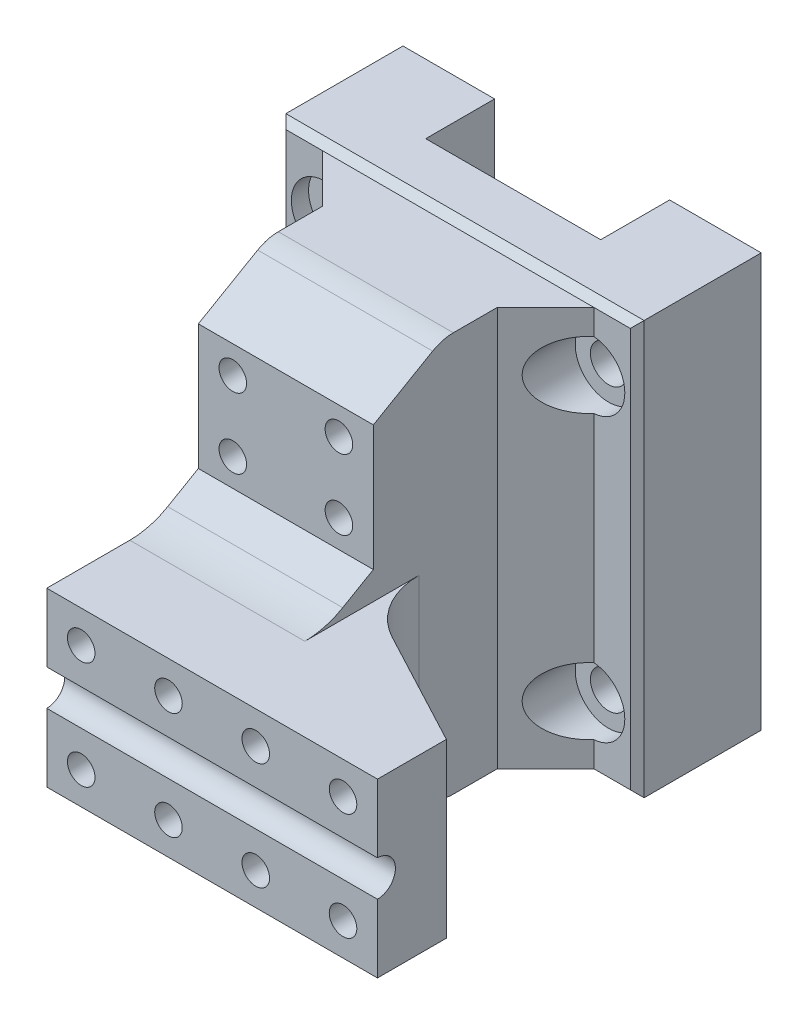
ISO-10303-21;
HEADER;
FILE_DESCRIPTION(('STEP AP214'),'2;1');
FILE_NAME('part.step','',(''),(''),'','','');
FILE_SCHEMA(('AUTOMOTIVE_DESIGN { 1 0 10303 214 1 1 1 1 }'));
ENDSEC;
DATA;
#1=APPLICATION_CONTEXT('core data for automotive mechanical design processes');
#2=APPLICATION_PROTOCOL_DEFINITION('international standard','automotive_design',2000,#1);
#3=PRODUCT_CONTEXT('',#1,'mechanical');
#4=PRODUCT('Part','Part','',(#3));
#5=PRODUCT_RELATED_PRODUCT_CATEGORY('part','',(#4));
#6=PRODUCT_DEFINITION_FORMATION('','',#4);
#7=PRODUCT_DEFINITION_CONTEXT('part definition',#1,'design');
#8=PRODUCT_DEFINITION('design','',#6,#7);
#9=PRODUCT_DEFINITION_SHAPE('','',#8);
#10=(LENGTH_UNIT() NAMED_UNIT(*) SI_UNIT(.MILLI.,.METRE.));
#11=(NAMED_UNIT(*) PLANE_ANGLE_UNIT() SI_UNIT($,.RADIAN.));
#12=(NAMED_UNIT(*) SI_UNIT($,.STERADIAN.) SOLID_ANGLE_UNIT());
#13=UNCERTAINTY_MEASURE_WITH_UNIT(LENGTH_MEASURE(1.E-05),#10,'distance_accuracy_value','');
#14=(GEOMETRIC_REPRESENTATION_CONTEXT(3) GLOBAL_UNCERTAINTY_ASSIGNED_CONTEXT((#13)) GLOBAL_UNIT_ASSIGNED_CONTEXT((#10,
#11,#12)) REPRESENTATION_CONTEXT('',''));
#15=CARTESIAN_POINT('',(0.,0.,0.));
#16=DIRECTION('',(0.,0.,1.));
#17=DIRECTION('',(1.,0.,0.));
#18=AXIS2_PLACEMENT_3D('',#15,#16,#17);
#19=CARTESIAN_POINT('',(0.,5.95357096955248E-13,55.0000000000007));
#20=DIRECTION('',(0.,0.,1.));
#21=DIRECTION('',(0.,-1.,0.));
#22=AXIS2_PLACEMENT_3D('',#19,#20,#21);
#23=PLANE('',#22);
#24=CARTESIAN_POINT('',(-11.6666666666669,116.3,55.0000000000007));
#25=DIRECTION('',(0.,0.,1.));
#26=DIRECTION('',(1.,0.,0.));
#27=AXIS2_PLACEMENT_3D('',#24,#25,#26);
#28=CIRCLE('',#27,2.);
#29=CARTESIAN_POINT('',(-9.66666666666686,116.3,55.0000000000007));
#30=VERTEX_POINT('',#29);
#31=EDGE_CURVE('E760',#30,#30,#28,.T.);
#32=ORIENTED_EDGE('',*,*,#31,.F.);
#33=EDGE_LOOP('',(#32));
#34=FACE_BOUND('',#33,.T.);
#35=CARTESIAN_POINT('',(-24.3333333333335,116.3,55.0000000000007));
#36=DIRECTION('',(0.,0.,1.));
#37=DIRECTION('',(1.,0.,0.));
#38=AXIS2_PLACEMENT_3D('',#35,#36,#37);
#39=CIRCLE('',#38,2.);
#40=CARTESIAN_POINT('',(-22.3333333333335,116.3,55.0000000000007));
#41=VERTEX_POINT('',#40);
#42=EDGE_CURVE('E764',#41,#41,#39,.T.);
#43=ORIENTED_EDGE('',*,*,#42,.F.);
#44=EDGE_LOOP('',(#43));
#45=FACE_BOUND('',#44,.T.);
#46=CARTESIAN_POINT('',(-37.0000000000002,116.3,55.0000000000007));
#47=DIRECTION('',(0.,0.,1.));
#48=DIRECTION('',(1.,0.,0.));
#49=AXIS2_PLACEMENT_3D('',#46,#47,#48);
#50=CIRCLE('',#49,2.);
#51=CARTESIAN_POINT('',(-35.0000000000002,116.3,55.0000000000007));
#52=VERTEX_POINT('',#51);
#53=EDGE_CURVE('E768',#52,#52,#50,.T.);
#54=ORIENTED_EDGE('',*,*,#53,.F.);
#55=EDGE_LOOP('',(#54));
#56=FACE_BOUND('',#55,.T.);
#57=CARTESIAN_POINT('',(0.999999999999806,116.3,55.0000000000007));
#58=DIRECTION('',(0.,0.,1.));
#59=DIRECTION('',(1.,0.,0.));
#60=AXIS2_PLACEMENT_3D('',#57,#58,#59);
#61=CIRCLE('',#60,2.);
#62=CARTESIAN_POINT('',(2.99999999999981,116.3,55.0000000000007));
#63=VERTEX_POINT('',#62);
#64=EDGE_CURVE('E771',#63,#63,#61,.T.);
#65=ORIENTED_EDGE('',*,*,#64,.F.);
#66=EDGE_LOOP('',(#65));
#67=FACE_BOUND('',#66,.T.);
#68=DIRECTION('',(-1.,0.,0.));
#69=VECTOR('',#68,1.);
#70=CARTESIAN_POINT('',(5.99999999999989,111.1,54.9999999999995));
#71=LINE('',#70,#69);
#72=CARTESIAN_POINT('',(5.99999999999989,111.1,54.9999999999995));
#73=VERTEX_POINT('',#72);
#74=CARTESIAN_POINT('',(-42.,111.1,54.9999999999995));
#75=VERTEX_POINT('',#74);
#76=EDGE_CURVE('E353',#73,#75,#71,.T.);
#77=ORIENTED_EDGE('',*,*,#76,.F.);
#78=DIRECTION('',(0.,-1.,0.));
#79=VECTOR('',#78,1.);
#80=CARTESIAN_POINT('',(5.9999999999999,121.,54.9999999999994));
#81=LINE('',#80,#79);
#82=CARTESIAN_POINT('',(5.9999999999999,121.,54.9999999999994));
#83=VERTEX_POINT('',#82);
#84=EDGE_CURVE('E381',#83,#73,#81,.T.);
#85=ORIENTED_EDGE('',*,*,#84,.F.);
#86=DIRECTION('',(1.,0.,0.));
#87=VECTOR('',#86,1.);
#88=CARTESIAN_POINT('',(-16.6000000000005,121.,54.9999999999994));
#89=LINE('',#88,#87);
#90=CARTESIAN_POINT('',(-42.0000000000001,121.,54.9999999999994));
#91=VERTEX_POINT('',#90);
#92=EDGE_CURVE('E376',#91,#83,#89,.T.);
#93=ORIENTED_EDGE('',*,*,#92,.F.);
#94=DIRECTION('',(0.,1.,0.));
#95=VECTOR('',#94,1.);
#96=CARTESIAN_POINT('',(-42.0000000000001,121.,54.9999999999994));
#97=LINE('',#96,#95);
#98=EDGE_CURVE('E369',#75,#91,#97,.T.);
#99=ORIENTED_EDGE('',*,*,#98,.F.);
#100=EDGE_LOOP('',(#77,#85,#93,#99));
#101=FACE_BOUND('',#100,.T.);
#102=ADVANCED_FACE('F103',(#34,#45,#56,#67,#101),#23,.T.);
#103=CARTESIAN_POINT('',(0.,0.,33.));
#104=DIRECTION('',(0.,0.,1.));
#105=DIRECTION('',(1.,0.,0.));
#106=AXIS2_PLACEMENT_3D('',#103,#104,#105);
#107=PLANE('',#106);
#108=CARTESIAN_POINT('',(-21.6000000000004,129.041451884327,33.));
#109=DIRECTION('',(0.,0.,1.));
#110=DIRECTION('',(1.,0.,0.));
#111=AXIS2_PLACEMENT_3D('',#108,#109,#110);
#112=CIRCLE('',#111,2.);
#113=CARTESIAN_POINT('',(-19.6000000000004,129.041451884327,33.));
#114=VERTEX_POINT('',#113);
#115=EDGE_CURVE('E1512',#114,#114,#112,.T.);
#116=ORIENTED_EDGE('',*,*,#115,.F.);
#117=EDGE_LOOP('',(#116));
#118=FACE_BOUND('',#117,.T.);
#119=CARTESIAN_POINT('',(-37.,139.226497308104,33.));
#120=DIRECTION('',(0.,0.,1.));
#121=DIRECTION('',(1.,0.,0.));
#122=AXIS2_PLACEMENT_3D('',#119,#120,#121);
#123=CIRCLE('',#122,2.);
#124=CARTESIAN_POINT('',(-35.,139.226497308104,33.));
#125=VERTEX_POINT('',#124);
#126=EDGE_CURVE('E1526',#125,#125,#123,.T.);
#127=ORIENTED_EDGE('',*,*,#126,.F.);
#128=EDGE_LOOP('',(#127));
#129=FACE_BOUND('',#128,.T.);
#130=CARTESIAN_POINT('',(-37.,129.041451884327,33.));
#131=DIRECTION('',(0.,0.,1.));
#132=DIRECTION('',(1.,0.,0.));
#133=AXIS2_PLACEMENT_3D('',#130,#131,#132);
#134=CIRCLE('',#133,2.);
#135=CARTESIAN_POINT('',(-35.,129.041451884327,33.));
#136=VERTEX_POINT('',#135);
#137=EDGE_CURVE('E1521',#136,#136,#134,.T.);
#138=ORIENTED_EDGE('',*,*,#137,.F.);
#139=EDGE_LOOP('',(#138));
#140=FACE_BOUND('',#139,.T.);
#141=CARTESIAN_POINT('',(-21.6000000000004,139.226497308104,33.));
#142=DIRECTION('',(0.,0.,1.));
#143=DIRECTION('',(1.,0.,0.));
#144=AXIS2_PLACEMENT_3D('',#141,#142,#143);
#145=CIRCLE('',#144,2.);
#146=CARTESIAN_POINT('',(-19.6000000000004,139.226497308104,33.));
#147=VERTEX_POINT('',#146);
#148=EDGE_CURVE('E1511',#147,#147,#145,.T.);
#149=ORIENTED_EDGE('',*,*,#148,.F.);
#150=EDGE_LOOP('',(#149));
#151=FACE_BOUND('',#150,.T.);
#152=DIRECTION('',(0.,-1.,0.));
#153=VECTOR('',#152,1.);
#154=CARTESIAN_POINT('',(-42.,90.9999999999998,33.));
#155=LINE('',#154,#153);
#156=CARTESIAN_POINT('',(-42.,143.226497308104,33.));
#157=VERTEX_POINT('',#156);
#158=CARTESIAN_POINT('',(-42.,125.041451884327,33.));
#159=VERTEX_POINT('',#158);
#160=EDGE_CURVE('E456',#157,#159,#155,.T.);
#161=ORIENTED_EDGE('',*,*,#160,.T.);
#162=DIRECTION('',(1.,0.,0.));
#163=VECTOR('',#162,1.);
#164=CARTESIAN_POINT('',(-16.6000000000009,125.041451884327,33.));
#165=LINE('',#164,#163);
#166=CARTESIAN_POINT('',(-16.6000000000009,125.041451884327,33.));
#167=VERTEX_POINT('',#166);
#168=EDGE_CURVE('E364',#159,#167,#165,.T.);
#169=ORIENTED_EDGE('',*,*,#168,.T.);
#170=DIRECTION('',(0.,1.,0.));
#171=VECTOR('',#170,1.);
#172=CARTESIAN_POINT('',(-16.6000000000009,90.9999999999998,33.));
#173=LINE('',#172,#171);
#174=CARTESIAN_POINT('',(-16.6000000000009,143.226497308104,33.));
#175=VERTEX_POINT('',#174);
#176=EDGE_CURVE('E460',#167,#175,#173,.T.);
#177=ORIENTED_EDGE('',*,*,#176,.T.);
#178=DIRECTION('',(-1.,0.,0.));
#179=VECTOR('',#178,1.);
#180=CARTESIAN_POINT('',(-42.,143.226497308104,33.));
#181=LINE('',#180,#179);
#182=EDGE_CURVE('E455',#175,#157,#181,.T.);
#183=ORIENTED_EDGE('',*,*,#182,.T.);
#184=EDGE_LOOP('',(#161,#169,#177,#183));
#185=FACE_BOUND('',#184,.T.);
#186=ADVANCED_FACE('F580',(#118,#129,#140,#151,#185),#107,.T.);
#187=CARTESIAN_POINT('',(0.,0.,8.));
#188=DIRECTION('',(0.,0.,1.));
#189=DIRECTION('',(1.,0.,0.));
#190=AXIS2_PLACEMENT_3D('',#187,#188,#189);
#191=PLANE('',#190);
#192=DIRECTION('',(1.,0.,0.));
#193=VECTOR('',#192,1.);
#194=CARTESIAN_POINT('',(-3.30000000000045,90.9999999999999,8.));
#195=LINE('',#194,#193);
#196=CARTESIAN_POINT('',(-54.3000000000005,90.9999999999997,8.));
#197=VERTEX_POINT('',#196);
#198=CARTESIAN_POINT('',(-49.,90.9999999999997,8.));
#199=VERTEX_POINT('',#198);
#200=EDGE_CURVE('E962',#197,#199,#195,.T.);
#201=ORIENTED_EDGE('',*,*,#200,.T.);
#202=DIRECTION('',(0.,1.,0.));
#203=VECTOR('',#202,1.);
#204=CARTESIAN_POINT('',(-49.,0.,8.));
#205=LINE('',#204,#203);
#206=CARTESIAN_POINT('',(-49.,94.6626453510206,8.));
#207=VERTEX_POINT('',#206);
#208=EDGE_CURVE('E1012',#199,#207,#205,.T.);
#209=ORIENTED_EDGE('',*,*,#208,.T.);
#210=CARTESIAN_POINT('',(-48.6500000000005,99.4999999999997,8.));
#211=DIRECTION('',(0.,0.,1.));
#212=DIRECTION('',(1.,0.,0.));
#213=AXIS2_PLACEMENT_3D('',#210,#211,#212);
#214=CIRCLE('',#213,4.85);
#215=CARTESIAN_POINT('',(-49.,104.337354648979,8.));
#216=VERTEX_POINT('',#215);
#217=EDGE_CURVE('E868',#216,#207,#214,.T.);
#218=ORIENTED_EDGE('',*,*,#217,.F.);
#219=DIRECTION('',(0.,1.,0.));
#220=VECTOR('',#219,1.);
#221=CARTESIAN_POINT('',(-49.,0.,8.));
#222=LINE('',#221,#220);
#223=CARTESIAN_POINT('',(-49.,135.662645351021,8.));
#224=VERTEX_POINT('',#223);
#225=EDGE_CURVE('E1010',#216,#224,#222,.T.);
#226=ORIENTED_EDGE('',*,*,#225,.T.);
#227=CARTESIAN_POINT('',(-48.6500000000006,140.5,8.));
#228=DIRECTION('',(0.,0.,1.));
#229=DIRECTION('',(1.,0.,0.));
#230=AXIS2_PLACEMENT_3D('',#227,#228,#229);
#231=CIRCLE('',#230,4.85);
#232=CARTESIAN_POINT('',(-49.,145.337354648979,8.));
#233=VERTEX_POINT('',#232);
#234=EDGE_CURVE('E867',#233,#224,#231,.T.);
#235=ORIENTED_EDGE('',*,*,#234,.F.);
#236=DIRECTION('',(0.,1.,0.));
#237=VECTOR('',#236,1.);
#238=CARTESIAN_POINT('',(-49.,0.,8.));
#239=LINE('',#238,#237);
#240=CARTESIAN_POINT('',(-49.,149.,8.));
#241=VERTEX_POINT('',#240);
#242=EDGE_CURVE('E1007',#233,#241,#239,.T.);
#243=ORIENTED_EDGE('',*,*,#242,.T.);
#244=DIRECTION('',(-1.,0.,0.));
#245=VECTOR('',#244,1.);
#246=CARTESIAN_POINT('',(-55.3000000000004,149.,8.));
#247=LINE('',#246,#245);
#248=CARTESIAN_POINT('',(-54.3000000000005,149.,8.));
#249=VERTEX_POINT('',#248);
#250=EDGE_CURVE('E955',#241,#249,#247,.T.);
#251=ORIENTED_EDGE('',*,*,#250,.T.);
#252=DIRECTION('',(0.,-1.,0.));
#253=VECTOR('',#252,1.);
#254=CARTESIAN_POINT('',(-54.3000000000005,89.9999999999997,8.));
#255=LINE('',#254,#253);
#256=EDGE_CURVE('E953',#249,#197,#255,.T.);
#257=ORIENTED_EDGE('',*,*,#256,.T.);
#258=EDGE_LOOP('',(#201,#209,#218,#226,#235,#243,#251,#257));
#259=FACE_BOUND('',#258,.T.);
#260=ADVANCED_FACE('F583',(#259),#191,.T.);
#261=CARTESIAN_POINT('',(-9.95000000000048,99.4999999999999,-10.));
#262=DIRECTION('',(0.,0.,1.));
#263=DIRECTION('',(1.,0.,0.));
#264=AXIS2_PLACEMENT_3D('',#261,#262,#263);
#265=CYLINDRICAL_SURFACE('',#264,2.65);
#266=CARTESIAN_POINT('',(-9.95000000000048,99.4999999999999,-10.));
#267=DIRECTION('',(0.,0.,1.));
#268=DIRECTION('',(1.,0.,0.));
#269=AXIS2_PLACEMENT_3D('',#266,#267,#268);
#270=CIRCLE('',#269,2.65);
#271=CARTESIAN_POINT('',(-7.30000000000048,99.4999999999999,-10.));
#272=VERTEX_POINT('',#271);
#273=EDGE_CURVE('E888',#272,#272,#270,.T.);
#274=ORIENTED_EDGE('',*,*,#273,.F.);
#275=EDGE_LOOP('',(#274));
#276=FACE_BOUND('',#275,.T.);
#277=CARTESIAN_POINT('',(-9.95000000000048,99.4999999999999,5.5));
#278=DIRECTION('',(0.,0.,1.));
#279=DIRECTION('',(1.,0.,0.));
#280=AXIS2_PLACEMENT_3D('',#277,#278,#279);
#281=CIRCLE('',#280,2.65);
#282=CARTESIAN_POINT('',(-7.30000000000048,99.4999999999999,5.5));
#283=VERTEX_POINT('',#282);
#284=EDGE_CURVE('E979',#283,#283,#281,.F.);
#285=ORIENTED_EDGE('',*,*,#284,.F.);
#286=EDGE_LOOP('',(#285));
#287=FACE_BOUND('',#286,.T.);
#288=ADVANCED_FACE('F633',(#276,#287),#265,.F.);
#289=CARTESIAN_POINT('',(-9.95000000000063,140.5,-10.));
#290=DIRECTION('',(0.,0.,1.));
#291=DIRECTION('',(1.,0.,0.));
#292=AXIS2_PLACEMENT_3D('',#289,#290,#291);
#293=CYLINDRICAL_SURFACE('',#292,2.65);
#294=CARTESIAN_POINT('',(-9.95000000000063,140.5,-10.));
#295=DIRECTION('',(0.,0.,1.));
#296=DIRECTION('',(1.,0.,0.));
#297=AXIS2_PLACEMENT_3D('',#294,#295,#296);
#298=CIRCLE('',#297,2.65);
#299=CARTESIAN_POINT('',(-7.30000000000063,140.5,-10.));
#300=VERTEX_POINT('',#299);
#301=EDGE_CURVE('E892',#300,#300,#298,.T.);
#302=ORIENTED_EDGE('',*,*,#301,.F.);
#303=EDGE_LOOP('',(#302));
#304=FACE_BOUND('',#303,.T.);
#305=CARTESIAN_POINT('',(-9.95000000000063,140.5,5.5));
#306=DIRECTION('',(0.,0.,1.));
#307=DIRECTION('',(1.,0.,0.));
#308=AXIS2_PLACEMENT_3D('',#305,#306,#307);
#309=CIRCLE('',#308,2.65);
#310=CARTESIAN_POINT('',(-7.30000000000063,140.5,5.5));
#311=VERTEX_POINT('',#310);
#312=EDGE_CURVE('E991',#311,#311,#309,.F.);
#313=ORIENTED_EDGE('',*,*,#312,.F.);
#314=EDGE_LOOP('',(#313));
#315=FACE_BOUND('',#314,.T.);
#316=ADVANCED_FACE('F636',(#304,#315),#293,.F.);
#317=CARTESIAN_POINT('',(-48.6500000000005,99.4999999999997,-10.));
#318=DIRECTION('',(0.,0.,1.));
#319=DIRECTION('',(1.,0.,0.));
#320=AXIS2_PLACEMENT_3D('',#317,#318,#319);
#321=CYLINDRICAL_SURFACE('',#320,2.65);
#322=CARTESIAN_POINT('',(-48.6500000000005,99.4999999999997,-10.));
#323=DIRECTION('',(0.,0.,1.));
#324=DIRECTION('',(1.,0.,0.));
#325=AXIS2_PLACEMENT_3D('',#322,#323,#324);
#326=CIRCLE('',#325,2.65);
#327=CARTESIAN_POINT('',(-46.0000000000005,99.4999999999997,-10.));
#328=VERTEX_POINT('',#327);
#329=EDGE_CURVE('E891',#328,#328,#326,.T.);
#330=ORIENTED_EDGE('',*,*,#329,.F.);
#331=EDGE_LOOP('',(#330));
#332=FACE_BOUND('',#331,.T.);
#333=CARTESIAN_POINT('',(-48.6500000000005,99.4999999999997,5.5));
#334=DIRECTION('',(0.,0.,1.));
#335=DIRECTION('',(1.,0.,0.));
#336=AXIS2_PLACEMENT_3D('',#333,#334,#335);
#337=CIRCLE('',#336,2.65);
#338=CARTESIAN_POINT('',(-46.0000000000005,99.4999999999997,5.5));
#339=VERTEX_POINT('',#338);
#340=EDGE_CURVE('E988',#339,#339,#337,.F.);
#341=ORIENTED_EDGE('',*,*,#340,.F.);
#342=EDGE_LOOP('',(#341));
#343=FACE_BOUND('',#342,.T.);
#344=ADVANCED_FACE('F640',(#332,#343),#321,.F.);
#345=CARTESIAN_POINT('',(-48.6500000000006,140.5,-10.));
#346=DIRECTION('',(0.,0.,1.));
#347=DIRECTION('',(1.,0.,0.));
#348=AXIS2_PLACEMENT_3D('',#345,#346,#347);
#349=CYLINDRICAL_SURFACE('',#348,2.65);
#350=CARTESIAN_POINT('',(-48.6500000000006,140.5,-10.));
#351=DIRECTION('',(0.,0.,1.));
#352=DIRECTION('',(1.,0.,0.));
#353=AXIS2_PLACEMENT_3D('',#350,#351,#352);
#354=CIRCLE('',#353,2.65);
#355=CARTESIAN_POINT('',(-46.0000000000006,140.5,-10.));
#356=VERTEX_POINT('',#355);
#357=EDGE_CURVE('E895',#356,#356,#354,.T.);
#358=ORIENTED_EDGE('',*,*,#357,.F.);
#359=EDGE_LOOP('',(#358));
#360=FACE_BOUND('',#359,.T.);
#361=CARTESIAN_POINT('',(-48.6500000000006,140.5,5.5));
#362=DIRECTION('',(0.,0.,1.));
#363=DIRECTION('',(1.,0.,0.));
#364=AXIS2_PLACEMENT_3D('',#361,#362,#363);
#365=CIRCLE('',#364,2.65);
#366=CARTESIAN_POINT('',(-46.0000000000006,140.5,5.5));
#367=VERTEX_POINT('',#366);
#368=EDGE_CURVE('E885',#367,#367,#365,.F.);
#369=ORIENTED_EDGE('',*,*,#368,.F.);
#370=EDGE_LOOP('',(#369));
#371=FACE_BOUND('',#370,.T.);
#372=ADVANCED_FACE('F642',(#360,#371),#349,.F.);
#373=CARTESIAN_POINT('',(0.,0.,0.));
#374=DIRECTION('',(0.,0.,1.));
#375=DIRECTION('',(1.,0.,0.));
#376=AXIS2_PLACEMENT_3D('',#373,#374,#375);
#377=PLANE('',#376);
#378=DIRECTION('',(-1.,0.,0.));
#379=VECTOR('',#378,1.);
#380=CARTESIAN_POINT('',(-42.,150.,0.));
#381=LINE('',#380,#379);
#382=CARTESIAN_POINT('',(-16.6000000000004,150.,0.));
#383=VERTEX_POINT('',#382);
#384=CARTESIAN_POINT('',(-42.,150.,0.));
#385=VERTEX_POINT('',#384);
#386=EDGE_CURVE('E943',#383,#385,#381,.T.);
#387=ORIENTED_EDGE('',*,*,#386,.F.);
#388=DIRECTION('',(0.,-1.,0.));
#389=VECTOR('',#388,1.);
#390=CARTESIAN_POINT('',(-16.6000000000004,150.,0.));
#391=LINE('',#390,#389);
#392=CARTESIAN_POINT('',(-16.6000000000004,89.9999999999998,0.));
#393=VERTEX_POINT('',#392);
#394=EDGE_CURVE('E907',#383,#393,#391,.T.);
#395=ORIENTED_EDGE('',*,*,#394,.T.);
#396=DIRECTION('',(1.,0.,0.));
#397=VECTOR('',#396,1.);
#398=CARTESIAN_POINT('',(-16.6000000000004,89.9999999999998,0.));
#399=LINE('',#398,#397);
#400=CARTESIAN_POINT('',(-42.,89.9999999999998,0.));
#401=VERTEX_POINT('',#400);
#402=EDGE_CURVE('E940',#401,#393,#399,.T.);
#403=ORIENTED_EDGE('',*,*,#402,.F.);
#404=DIRECTION('',(0.,-1.,0.));
#405=VECTOR('',#404,1.);
#406=CARTESIAN_POINT('',(-42.,150.,0.));
#407=LINE('',#406,#405);
#408=EDGE_CURVE('E910',#385,#401,#407,.T.);
#409=ORIENTED_EDGE('',*,*,#408,.F.);
#410=EDGE_LOOP('',(#387,#395,#403,#409));
#411=FACE_BOUND('',#410,.T.);
#412=ADVANCED_FACE('F645',(#411),#377,.F.);
#413=CARTESIAN_POINT('',(-55.3000000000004,89.9999999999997,8.));
#414=DIRECTION('',(1.,0.,0.));
#415=DIRECTION('',(0.,0.,-1.));
#416=AXIS2_PLACEMENT_3D('',#413,#414,#415);
#417=PLANE('',#416);
#418=DIRECTION('',(0.,0.,-1.));
#419=VECTOR('',#418,1.);
#420=CARTESIAN_POINT('',(-55.3000000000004,89.9999999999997,8.));
#421=LINE('',#420,#419);
#422=CARTESIAN_POINT('',(-55.3000000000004,89.9999999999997,7.));
#423=VERTEX_POINT('',#422);
#424=CARTESIAN_POINT('',(-55.3000000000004,89.9999999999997,-10.));
#425=VERTEX_POINT('',#424);
#426=EDGE_CURVE('E949',#423,#425,#421,.T.);
#427=ORIENTED_EDGE('',*,*,#426,.F.);
#428=DIRECTION('',(0.,1.,0.));
#429=VECTOR('',#428,1.);
#430=CARTESIAN_POINT('',(-55.3000000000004,150.,7.));
#431=LINE('',#430,#429);
#432=CARTESIAN_POINT('',(-55.3000000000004,150.,7.));
#433=VERTEX_POINT('',#432);
#434=EDGE_CURVE('E972',#423,#433,#431,.T.);
#435=ORIENTED_EDGE('',*,*,#434,.T.);
#436=DIRECTION('',(0.,0.,-1.));
#437=VECTOR('',#436,1.);
#438=CARTESIAN_POINT('',(-55.3000000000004,150.,8.));
#439=LINE('',#438,#437);
#440=CARTESIAN_POINT('',(-55.3000000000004,150.,-10.));
#441=VERTEX_POINT('',#440);
#442=EDGE_CURVE('E951',#433,#441,#439,.T.);
#443=ORIENTED_EDGE('',*,*,#442,.T.);
#444=DIRECTION('',(0.,1.,0.));
#445=VECTOR('',#444,1.);
#446=CARTESIAN_POINT('',(-55.3000000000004,89.9999999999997,-10.));
#447=LINE('',#446,#445);
#448=EDGE_CURVE('E929',#425,#441,#447,.T.);
#449=ORIENTED_EDGE('',*,*,#448,.F.);
#450=EDGE_LOOP('',(#427,#435,#443,#449));
#451=FACE_BOUND('',#450,.T.);
#452=ADVANCED_FACE('F674',(#451),#417,.F.);
#453=CARTESIAN_POINT('',(-16.6000000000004,89.9999999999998,8.));
#454=DIRECTION('',(0.,1.,0.));
#455=DIRECTION('',(-1.,0.,0.));
#456=AXIS2_PLACEMENT_3D('',#453,#454,#455);
#457=PLANE('',#456);
#458=DIRECTION('',(0.,0.,-1.));
#459=VECTOR('',#458,1.);
#460=CARTESIAN_POINT('',(-3.30000000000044,89.9999999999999,8.));
#461=LINE('',#460,#459);
#462=CARTESIAN_POINT('',(-3.30000000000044,89.9999999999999,7.));
#463=VERTEX_POINT('',#462);
#464=CARTESIAN_POINT('',(-3.30000000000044,89.9999999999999,-10.));
#465=VERTEX_POINT('',#464);
#466=EDGE_CURVE('E947',#463,#465,#461,.T.);
#467=ORIENTED_EDGE('',*,*,#466,.F.);
#468=DIRECTION('',(-1.,0.,0.));
#469=VECTOR('',#468,1.);
#470=CARTESIAN_POINT('',(-55.3000000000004,89.9999999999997,7.));
#471=LINE('',#470,#469);
#472=EDGE_CURVE('E965',#463,#423,#471,.T.);
#473=ORIENTED_EDGE('',*,*,#472,.T.);
#474=ORIENTED_EDGE('',*,*,#426,.T.);
#475=DIRECTION('',(-1.,0.,0.));
#476=VECTOR('',#475,1.);
#477=CARTESIAN_POINT('',(-42.,89.9999999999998,-10.));
#478=LINE('',#477,#476);
#479=CARTESIAN_POINT('',(-42.,89.9999999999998,-10.));
#480=VERTEX_POINT('',#479);
#481=EDGE_CURVE('E926',#480,#425,#478,.T.);
#482=ORIENTED_EDGE('',*,*,#481,.F.);
#483=DIRECTION('',(0.,0.,1.));
#484=VECTOR('',#483,1.);
#485=CARTESIAN_POINT('',(-42.,89.9999999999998,-10.));
#486=LINE('',#485,#484);
#487=EDGE_CURVE('E932',#480,#401,#486,.T.);
#488=ORIENTED_EDGE('',*,*,#487,.T.);
#489=ORIENTED_EDGE('',*,*,#402,.T.);
#490=DIRECTION('',(0.,0.,1.));
#491=VECTOR('',#490,1.);
#492=CARTESIAN_POINT('',(-16.6000000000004,89.9999999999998,-10.));
#493=LINE('',#492,#491);
#494=CARTESIAN_POINT('',(-16.6000000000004,89.9999999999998,-10.));
#495=VERTEX_POINT('',#494);
#496=EDGE_CURVE('E901',#495,#393,#493,.T.);
#497=ORIENTED_EDGE('',*,*,#496,.F.);
#498=DIRECTION('',(-1.,0.,0.));
#499=VECTOR('',#498,1.);
#500=CARTESIAN_POINT('',(-3.30000000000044,89.9999999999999,-10.));
#501=LINE('',#500,#499);
#502=EDGE_CURVE('E914',#465,#495,#501,.T.);
#503=ORIENTED_EDGE('',*,*,#502,.F.);
#504=EDGE_LOOP('',(#467,#473,#474,#482,#488,#489,#497,#503));
#505=FACE_BOUND('',#504,.T.);
#506=ADVANCED_FACE('F682',(#505),#457,.F.);
#507=CARTESIAN_POINT('',(-3.30000000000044,89.9999999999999,8.));
#508=DIRECTION('',(-1.,0.,0.));
#509=DIRECTION('',(0.,0.,1.));
#510=AXIS2_PLACEMENT_3D('',#507,#508,#509);
#511=PLANE('',#510);
#512=DIRECTION('',(0.,0.,-1.));
#513=VECTOR('',#512,1.);
#514=CARTESIAN_POINT('',(-3.30000000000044,150.,8.));
#515=LINE('',#514,#513);
#516=CARTESIAN_POINT('',(-3.30000000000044,150.,7.));
#517=VERTEX_POINT('',#516);
#518=CARTESIAN_POINT('',(-3.30000000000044,150.,-10.));
#519=VERTEX_POINT('',#518);
#520=EDGE_CURVE('E945',#517,#519,#515,.T.);
#521=ORIENTED_EDGE('',*,*,#520,.F.);
#522=DIRECTION('',(0.,-1.,0.));
#523=VECTOR('',#522,1.);
#524=CARTESIAN_POINT('',(-3.30000000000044,89.9999999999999,7.));
#525=LINE('',#524,#523);
#526=EDGE_CURVE('E968',#517,#463,#525,.T.);
#527=ORIENTED_EDGE('',*,*,#526,.T.);
#528=ORIENTED_EDGE('',*,*,#466,.T.);
#529=DIRECTION('',(0.,-1.,0.));
#530=VECTOR('',#529,1.);
#531=CARTESIAN_POINT('',(-3.30000000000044,150.,-10.));
#532=LINE('',#531,#530);
#533=EDGE_CURVE('E916',#519,#465,#532,.T.);
#534=ORIENTED_EDGE('',*,*,#533,.F.);
#535=EDGE_LOOP('',(#521,#527,#528,#534));
#536=FACE_BOUND('',#535,.T.);
#537=ADVANCED_FACE('F678',(#536),#511,.F.);
#538=CARTESIAN_POINT('',(-42.,150.,8.));
#539=DIRECTION('',(0.,-1.,0.));
#540=DIRECTION('',(0.,0.,-1.));
#541=AXIS2_PLACEMENT_3D('',#538,#539,#540);
#542=PLANE('',#541);
#543=ORIENTED_EDGE('',*,*,#442,.F.);
#544=DIRECTION('',(1.,0.,0.));
#545=VECTOR('',#544,1.);
#546=CARTESIAN_POINT('',(-3.30000000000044,150.,7.));
#547=LINE('',#546,#545);
#548=EDGE_CURVE('E970',#433,#517,#547,.T.);
#549=ORIENTED_EDGE('',*,*,#548,.T.);
#550=ORIENTED_EDGE('',*,*,#520,.T.);
#551=DIRECTION('',(1.,0.,0.));
#552=VECTOR('',#551,1.);
#553=CARTESIAN_POINT('',(-16.6000000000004,150.,-10.));
#554=LINE('',#553,#552);
#555=CARTESIAN_POINT('',(-16.6000000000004,150.,-10.));
#556=VERTEX_POINT('',#555);
#557=EDGE_CURVE('E911',#556,#519,#554,.T.);
#558=ORIENTED_EDGE('',*,*,#557,.F.);
#559=DIRECTION('',(0.,0.,1.));
#560=VECTOR('',#559,1.);
#561=CARTESIAN_POINT('',(-16.6000000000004,150.,-10.));
#562=LINE('',#561,#560);
#563=EDGE_CURVE('E903',#556,#383,#562,.T.);
#564=ORIENTED_EDGE('',*,*,#563,.T.);
#565=ORIENTED_EDGE('',*,*,#386,.T.);
#566=DIRECTION('',(0.,0.,1.));
#567=VECTOR('',#566,1.);
#568=CARTESIAN_POINT('',(-42.,150.,-10.));
#569=LINE('',#568,#567);
#570=CARTESIAN_POINT('',(-42.,150.,-10.));
#571=VERTEX_POINT('',#570);
#572=EDGE_CURVE('E937',#571,#385,#569,.T.);
#573=ORIENTED_EDGE('',*,*,#572,.F.);
#574=DIRECTION('',(1.,0.,0.));
#575=VECTOR('',#574,1.);
#576=CARTESIAN_POINT('',(-55.3000000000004,150.,-10.));
#577=LINE('',#576,#575);
#578=EDGE_CURVE('E921',#441,#571,#577,.T.);
#579=ORIENTED_EDGE('',*,*,#578,.F.);
#580=EDGE_LOOP('',(#543,#549,#550,#558,#564,#565,#573,#579));
#581=FACE_BOUND('',#580,.T.);
#582=ADVANCED_FACE('F670',(#581),#542,.F.);
#583=CARTESIAN_POINT('',(-4.30000000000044,149.,8.));
#584=VERTEX_POINT('',#583);
#585=CARTESIAN_POINT('',(-9.6000000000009,149.,8.));
#586=VERTEX_POINT('',#585);
#587=EDGE_CURVE('E956',#584,#586,#247,.T.);
#588=ORIENTED_EDGE('',*,*,#587,.T.);
#589=DIRECTION('',(0.,-1.,0.));
#590=VECTOR('',#589,1.);
#591=CARTESIAN_POINT('',(-9.6000000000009,0.,8.));
#592=LINE('',#591,#590);
#593=CARTESIAN_POINT('',(-9.6000000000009,145.337354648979,8.));
#594=VERTEX_POINT('',#593);
#595=EDGE_CURVE('E1003',#586,#594,#592,.T.);
#596=ORIENTED_EDGE('',*,*,#595,.T.);
#597=CARTESIAN_POINT('',(-9.95000000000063,140.5,8.));
#598=DIRECTION('',(0.,0.,1.));
#599=DIRECTION('',(1.,0.,0.));
#600=AXIS2_PLACEMENT_3D('',#597,#598,#599);
#601=CIRCLE('',#600,4.85);
#602=CARTESIAN_POINT('',(-9.6000000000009,135.662645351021,8.));
#603=VERTEX_POINT('',#602);
#604=EDGE_CURVE('E863',#603,#594,#601,.T.);
#605=ORIENTED_EDGE('',*,*,#604,.F.);
#606=DIRECTION('',(0.,-1.,0.));
#607=VECTOR('',#606,1.);
#608=CARTESIAN_POINT('',(-9.6000000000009,0.,8.));
#609=LINE('',#608,#607);
#610=CARTESIAN_POINT('',(-9.6000000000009,104.337354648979,8.));
#611=VERTEX_POINT('',#610);
#612=EDGE_CURVE('E1001',#603,#611,#609,.T.);
#613=ORIENTED_EDGE('',*,*,#612,.T.);
#614=CARTESIAN_POINT('',(-9.95000000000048,99.4999999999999,8.));
#615=DIRECTION('',(0.,0.,1.));
#616=DIRECTION('',(1.,0.,0.));
#617=AXIS2_PLACEMENT_3D('',#614,#615,#616);
#618=CIRCLE('',#617,4.85);
#619=CARTESIAN_POINT('',(-9.6000000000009,94.6626453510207,8.));
#620=VERTEX_POINT('',#619);
#621=EDGE_CURVE('E874',#620,#611,#618,.T.);
#622=ORIENTED_EDGE('',*,*,#621,.F.);
#623=DIRECTION('',(0.,-1.,0.));
#624=VECTOR('',#623,1.);
#625=CARTESIAN_POINT('',(-9.6000000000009,0.,8.));
#626=LINE('',#625,#624);
#627=CARTESIAN_POINT('',(-9.6000000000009,90.9999999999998,8.));
#628=VERTEX_POINT('',#627);
#629=EDGE_CURVE('E998',#620,#628,#626,.T.);
#630=ORIENTED_EDGE('',*,*,#629,.T.);
#631=CARTESIAN_POINT('',(-4.30000000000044,90.9999999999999,8.));
#632=VERTEX_POINT('',#631);
#633=EDGE_CURVE('E961',#628,#632,#195,.T.);
#634=ORIENTED_EDGE('',*,*,#633,.T.);
#635=DIRECTION('',(0.,1.,0.));
#636=VECTOR('',#635,1.);
#637=CARTESIAN_POINT('',(-4.30000000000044,150.,8.));
#638=LINE('',#637,#636);
#639=EDGE_CURVE('E959',#632,#584,#638,.T.);
#640=ORIENTED_EDGE('',*,*,#639,.T.);
#641=EDGE_LOOP('',(#588,#596,#605,#613,#622,#630,#634,#640));
#642=FACE_BOUND('',#641,.T.);
#643=ADVANCED_FACE('F666',(#642),#191,.T.);
#644=CARTESIAN_POINT('',(-42.,150.,-10.));
#645=DIRECTION('',(-1.,0.,0.));
#646=DIRECTION('',(0.,0.,1.));
#647=AXIS2_PLACEMENT_3D('',#644,#645,#646);
#648=PLANE('',#647);
#649=ORIENTED_EDGE('',*,*,#408,.T.);
#650=ORIENTED_EDGE('',*,*,#487,.F.);
#651=DIRECTION('',(0.,-1.,0.));
#652=VECTOR('',#651,1.);
#653=CARTESIAN_POINT('',(-42.,150.,-10.));
#654=LINE('',#653,#652);
#655=EDGE_CURVE('E924',#571,#480,#654,.T.);
#656=ORIENTED_EDGE('',*,*,#655,.F.);
#657=ORIENTED_EDGE('',*,*,#572,.T.);
#658=EDGE_LOOP('',(#649,#650,#656,#657));
#659=FACE_BOUND('',#658,.T.);
#660=ADVANCED_FACE('F662',(#659),#648,.F.);
#661=CARTESIAN_POINT('',(0.,0.,-10.));
#662=DIRECTION('',(0.,0.,-1.));
#663=DIRECTION('',(-1.,0.,0.));
#664=AXIS2_PLACEMENT_3D('',#661,#662,#663);
#665=PLANE('',#664);
#666=ORIENTED_EDGE('',*,*,#357,.T.);
#667=EDGE_LOOP('',(#666));
#668=FACE_BOUND('',#667,.T.);
#669=ORIENTED_EDGE('',*,*,#329,.T.);
#670=EDGE_LOOP('',(#669));
#671=FACE_BOUND('',#670,.T.);
#672=ORIENTED_EDGE('',*,*,#578,.T.);
#673=ORIENTED_EDGE('',*,*,#655,.T.);
#674=ORIENTED_EDGE('',*,*,#481,.T.);
#675=ORIENTED_EDGE('',*,*,#448,.T.);
#676=EDGE_LOOP('',(#672,#673,#674,#675));
#677=FACE_BOUND('',#676,.T.);
#678=ADVANCED_FACE('F654',(#668,#671,#677),#665,.T.);
#679=CARTESIAN_POINT('',(-16.6000000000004,150.,-10.));
#680=DIRECTION('',(-1.,0.,0.));
#681=DIRECTION('',(0.,0.,1.));
#682=AXIS2_PLACEMENT_3D('',#679,#680,#681);
#683=PLANE('',#682);
#684=ORIENTED_EDGE('',*,*,#394,.F.);
#685=ORIENTED_EDGE('',*,*,#563,.F.);
#686=DIRECTION('',(0.,-1.,0.));
#687=VECTOR('',#686,1.);
#688=CARTESIAN_POINT('',(-16.6000000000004,150.,-10.));
#689=LINE('',#688,#687);
#690=EDGE_CURVE('E906',#556,#495,#689,.T.);
#691=ORIENTED_EDGE('',*,*,#690,.T.);
#692=ORIENTED_EDGE('',*,*,#496,.T.);
#693=EDGE_LOOP('',(#684,#685,#691,#692));
#694=FACE_BOUND('',#693,.T.);
#695=ADVANCED_FACE('F650',(#694),#683,.T.);
#696=CARTESIAN_POINT('',(0.,0.,-10.));
#697=DIRECTION('',(0.,0.,-1.));
#698=DIRECTION('',(-1.,0.,0.));
#699=AXIS2_PLACEMENT_3D('',#696,#697,#698);
#700=PLANE('',#699);
#701=ORIENTED_EDGE('',*,*,#301,.T.);
#702=EDGE_LOOP('',(#701));
#703=FACE_BOUND('',#702,.T.);
#704=ORIENTED_EDGE('',*,*,#273,.T.);
#705=EDGE_LOOP('',(#704));
#706=FACE_BOUND('',#705,.T.);
#707=ORIENTED_EDGE('',*,*,#557,.T.);
#708=ORIENTED_EDGE('',*,*,#533,.T.);
#709=ORIENTED_EDGE('',*,*,#502,.T.);
#710=ORIENTED_EDGE('',*,*,#690,.F.);
#711=EDGE_LOOP('',(#707,#708,#709,#710));
#712=FACE_BOUND('',#711,.T.);
#713=ADVANCED_FACE('F653',(#703,#706,#712),#700,.T.);
#714=CARTESIAN_POINT('',(0.,149.,8.));
#715=DIRECTION('',(0.,0.707106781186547,0.707106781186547));
#716=DIRECTION('',(1.,0.,0.));
#717=AXIS2_PLACEMENT_3D('',#714,#715,#716);
#718=PLANE('',#717);
#719=DIRECTION('',(0.577350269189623,0.577350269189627,-0.577350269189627));
#720=VECTOR('',#719,1.);
#721=CARTESIAN_POINT('',(-2.86666666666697,150.433333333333,6.56666666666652));
#722=LINE('',#721,#720);
#723=EDGE_CURVE('E981',#517,#584,#722,.F.);
#724=ORIENTED_EDGE('',*,*,#723,.F.);
#725=ORIENTED_EDGE('',*,*,#548,.F.);
#726=DIRECTION('',(-0.577350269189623,0.577350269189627,-0.577350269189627));
#727=VECTOR('',#726,1.);
#728=CARTESIAN_POINT('',(-4.63333333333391,99.3333333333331,57.6666666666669));
#729=LINE('',#728,#727);
#730=EDGE_CURVE('E898',#249,#433,#729,.T.);
#731=ORIENTED_EDGE('',*,*,#730,.F.);
#732=ORIENTED_EDGE('',*,*,#250,.F.);
#733=DIRECTION('',(-1.,0.,0.));
#734=VECTOR('',#733,1.);
#735=CARTESIAN_POINT('',(-16.6000000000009,149.,8.));
#736=LINE('',#735,#734);
#737=EDGE_CURVE('E461',#586,#241,#736,.T.);
#738=ORIENTED_EDGE('',*,*,#737,.F.);
#739=ORIENTED_EDGE('',*,*,#587,.F.);
#740=EDGE_LOOP('',(#724,#725,#731,#732,#738,#739));
#741=FACE_BOUND('',#740,.T.);
#742=ADVANCED_FACE('F658',(#741),#718,.T.);
#743=CARTESIAN_POINT('',(-54.3000000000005,0.,8.));
#744=DIRECTION('',(-0.70710678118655,0.,0.707106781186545));
#745=DIRECTION('',(0.,1.,0.));
#746=AXIS2_PLACEMENT_3D('',#743,#744,#745);
#747=PLANE('',#746);
#748=ORIENTED_EDGE('',*,*,#730,.T.);
#749=ORIENTED_EDGE('',*,*,#434,.F.);
#750=DIRECTION('',(0.577350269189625,0.577350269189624,0.577350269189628));
#751=VECTOR('',#750,1.);
#752=CARTESIAN_POINT('',(-84.6333333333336,60.6666666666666,-22.3333333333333));
#753=LINE('',#752,#751);
#754=EDGE_CURVE('E978',#197,#423,#753,.F.);
#755=ORIENTED_EDGE('',*,*,#754,.F.);
#756=ORIENTED_EDGE('',*,*,#256,.F.);
#757=EDGE_LOOP('',(#748,#749,#755,#756));
#758=FACE_BOUND('',#757,.T.);
#759=ADVANCED_FACE('F704',(#758),#747,.T.);
#760=CARTESIAN_POINT('',(-4.30000000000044,0.,8.));
#761=DIRECTION('',(0.70710678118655,0.,0.707106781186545));
#762=DIRECTION('',(0.,-1.,0.));
#763=AXIS2_PLACEMENT_3D('',#760,#761,#762);
#764=PLANE('',#763);
#765=ORIENTED_EDGE('',*,*,#723,.T.);
#766=ORIENTED_EDGE('',*,*,#639,.F.);
#767=DIRECTION('',(0.577350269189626,-0.577350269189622,-0.57735026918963));
#768=VECTOR('',#767,1.);
#769=CARTESIAN_POINT('',(26.0333333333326,60.666666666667,-22.3333333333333));
#770=LINE('',#769,#768);
#771=EDGE_CURVE('E975',#463,#632,#770,.F.);
#772=ORIENTED_EDGE('',*,*,#771,.F.);
#773=ORIENTED_EDGE('',*,*,#526,.F.);
#774=EDGE_LOOP('',(#765,#766,#772,#773));
#775=FACE_BOUND('',#774,.T.);
#776=ADVANCED_FACE('F697',(#775),#764,.T.);
#777=CARTESIAN_POINT('',(-2.84859855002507E-13,90.9999999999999,8.));
#778=DIRECTION('',(0.,-0.707106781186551,0.707106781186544));
#779=DIRECTION('',(-1.,0.,0.));
#780=AXIS2_PLACEMENT_3D('',#777,#778,#779);
#781=PLANE('',#780);
#782=ORIENTED_EDGE('',*,*,#754,.T.);
#783=ORIENTED_EDGE('',*,*,#472,.F.);
#784=ORIENTED_EDGE('',*,*,#771,.T.);
#785=ORIENTED_EDGE('',*,*,#633,.F.);
#786=DIRECTION('',(1.,0.,0.));
#787=VECTOR('',#786,1.);
#788=CARTESIAN_POINT('',(-16.6000000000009,90.9999999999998,8.));
#789=LINE('',#788,#787);
#790=EDGE_CURVE('E399',#199,#628,#789,.T.);
#791=ORIENTED_EDGE('',*,*,#790,.F.);
#792=ORIENTED_EDGE('',*,*,#200,.F.);
#793=EDGE_LOOP('',(#782,#783,#784,#785,#791,#792));
#794=FACE_BOUND('',#793,.T.);
#795=ADVANCED_FACE('F628',(#794),#781,.T.);
#796=CARTESIAN_POINT('',(-48.6500000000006,140.5,5.5));
#797=DIRECTION('',(0.,0.,1.));
#798=DIRECTION('',(1.,0.,0.));
#799=AXIS2_PLACEMENT_3D('',#796,#797,#798);
#800=PLANE('',#799);
#801=CARTESIAN_POINT('',(-48.6500000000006,140.5,5.5));
#802=DIRECTION('',(0.,0.,1.));
#803=DIRECTION('',(1.,0.,0.));
#804=AXIS2_PLACEMENT_3D('',#801,#802,#803);
#805=CIRCLE('',#804,4.85);
#806=CARTESIAN_POINT('',(-43.8000000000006,140.5,5.5));
#807=VERTEX_POINT('',#806);
#808=EDGE_CURVE('E882',#807,#807,#805,.T.);
#809=ORIENTED_EDGE('',*,*,#808,.T.);
#810=EDGE_LOOP('',(#809));
#811=FACE_BOUND('',#810,.T.);
#812=ORIENTED_EDGE('',*,*,#368,.T.);
#813=EDGE_LOOP('',(#812));
#814=FACE_BOUND('',#813,.T.);
#815=ADVANCED_FACE('F625',(#811,#814),#800,.T.);
#816=CARTESIAN_POINT('',(-48.6500000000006,140.5,5.5));
#817=DIRECTION('',(0.,0.,1.));
#818=DIRECTION('',(1.,0.,0.));
#819=AXIS2_PLACEMENT_3D('',#816,#817,#818);
#820=CYLINDRICAL_SURFACE('',#819,4.85);
#821=ORIENTED_EDGE('',*,*,#808,.F.);
#822=EDGE_LOOP('',(#821));
#823=FACE_BOUND('',#822,.T.);
#824=ORIENTED_EDGE('',*,*,#234,.T.);
#825=CARTESIAN_POINT('',(-48.6500000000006,140.5,8.34999999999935));
#826=DIRECTION('',(0.707106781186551,0.,-0.707106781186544));
#827=DIRECTION('',(0.707106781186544,0.,0.707106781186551));
#828=AXIS2_PLACEMENT_3D('',#825,#826,#827);
#829=ELLIPSE('',#828,6.85893577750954,4.85);
#830=EDGE_CURVE('E1029',#224,#233,#829,.F.);
#831=ORIENTED_EDGE('',*,*,#830,.T.);
#832=EDGE_LOOP('',(#824,#831));
#833=FACE_BOUND('',#832,.T.);
#834=ADVANCED_FACE('F605',(#823,#833),#820,.F.);
#835=CARTESIAN_POINT('',(-48.6500000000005,99.4999999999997,5.5));
#836=DIRECTION('',(0.,0.,1.));
#837=DIRECTION('',(1.,0.,0.));
#838=AXIS2_PLACEMENT_3D('',#835,#836,#837);
#839=PLANE('',#838);
#840=CARTESIAN_POINT('',(-48.6500000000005,99.4999999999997,5.5));
#841=DIRECTION('',(0.,0.,1.));
#842=DIRECTION('',(1.,0.,0.));
#843=AXIS2_PLACEMENT_3D('',#840,#841,#842);
#844=CIRCLE('',#843,4.85);
#845=CARTESIAN_POINT('',(-43.8000000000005,99.4999999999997,5.5));
#846=VERTEX_POINT('',#845);
#847=EDGE_CURVE('E864',#846,#846,#844,.T.);
#848=ORIENTED_EDGE('',*,*,#847,.T.);
#849=EDGE_LOOP('',(#848));
#850=FACE_BOUND('',#849,.T.);
#851=ORIENTED_EDGE('',*,*,#340,.T.);
#852=EDGE_LOOP('',(#851));
#853=FACE_BOUND('',#852,.T.);
#854=ADVANCED_FACE('F601',(#850,#853),#839,.T.);
#855=CARTESIAN_POINT('',(-48.6500000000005,99.4999999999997,5.5));
#856=DIRECTION('',(0.,0.,1.));
#857=DIRECTION('',(1.,0.,0.));
#858=AXIS2_PLACEMENT_3D('',#855,#856,#857);
#859=CYLINDRICAL_SURFACE('',#858,4.85);
#860=ORIENTED_EDGE('',*,*,#847,.F.);
#861=EDGE_LOOP('',(#860));
#862=FACE_BOUND('',#861,.T.);
#863=ORIENTED_EDGE('',*,*,#217,.T.);
#864=CARTESIAN_POINT('',(-48.6500000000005,99.4999999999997,8.34999999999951));
#865=DIRECTION('',(0.707106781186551,0.,-0.707106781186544));
#866=DIRECTION('',(0.707106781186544,0.,0.707106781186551));
#867=AXIS2_PLACEMENT_3D('',#864,#865,#866);
#868=ELLIPSE('',#867,6.85893577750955,4.85);
#869=EDGE_CURVE('E1027',#207,#216,#868,.F.);
#870=ORIENTED_EDGE('',*,*,#869,.T.);
#871=EDGE_LOOP('',(#863,#870));
#872=FACE_BOUND('',#871,.T.);
#873=ADVANCED_FACE('F604',(#862,#872),#859,.F.);
#874=CARTESIAN_POINT('',(-9.95000000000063,140.5,5.5));
#875=DIRECTION('',(0.,0.,1.));
#876=DIRECTION('',(1.,0.,0.));
#877=AXIS2_PLACEMENT_3D('',#874,#875,#876);
#878=PLANE('',#877);
#879=CARTESIAN_POINT('',(-9.95000000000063,140.5,5.5));
#880=DIRECTION('',(0.,0.,1.));
#881=DIRECTION('',(1.,0.,0.));
#882=AXIS2_PLACEMENT_3D('',#879,#880,#881);
#883=CIRCLE('',#882,4.85);
#884=CARTESIAN_POINT('',(-5.10000000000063,140.5,5.5));
#885=VERTEX_POINT('',#884);
#886=EDGE_CURVE('E877',#885,#885,#883,.T.);
#887=ORIENTED_EDGE('',*,*,#886,.T.);
#888=EDGE_LOOP('',(#887));
#889=FACE_BOUND('',#888,.T.);
#890=ORIENTED_EDGE('',*,*,#312,.T.);
#891=EDGE_LOOP('',(#890));
#892=FACE_BOUND('',#891,.T.);
#893=ADVANCED_FACE('F609',(#889,#892),#878,.T.);
#894=CARTESIAN_POINT('',(-9.95000000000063,140.5,5.5));
#895=DIRECTION('',(0.,0.,1.));
#896=DIRECTION('',(1.,0.,0.));
#897=AXIS2_PLACEMENT_3D('',#894,#895,#896);
#898=CYLINDRICAL_SURFACE('',#897,4.85);
#899=ORIENTED_EDGE('',*,*,#886,.F.);
#900=EDGE_LOOP('',(#899));
#901=FACE_BOUND('',#900,.T.);
#902=ORIENTED_EDGE('',*,*,#604,.T.);
#903=CARTESIAN_POINT('',(-9.95000000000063,140.5,8.34999999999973));
#904=DIRECTION('',(-0.707106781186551,0.,-0.707106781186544));
#905=DIRECTION('',(-0.707106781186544,0.,0.707106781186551));
#906=AXIS2_PLACEMENT_3D('',#903,#904,#905);
#907=ELLIPSE('',#906,6.85893577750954,4.85);
#908=EDGE_CURVE('E1017',#594,#603,#907,.F.);
#909=ORIENTED_EDGE('',*,*,#908,.T.);
#910=EDGE_LOOP('',(#902,#909));
#911=FACE_BOUND('',#910,.T.);
#912=ADVANCED_FACE('F614',(#901,#911),#898,.F.);
#913=CARTESIAN_POINT('',(-9.95000000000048,99.4999999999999,5.5));
#914=DIRECTION('',(0.,0.,1.));
#915=DIRECTION('',(1.,0.,0.));
#916=AXIS2_PLACEMENT_3D('',#913,#914,#915);
#917=PLANE('',#916);
#918=CARTESIAN_POINT('',(-9.95000000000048,99.4999999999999,5.5));
#919=DIRECTION('',(0.,0.,1.));
#920=DIRECTION('',(1.,0.,0.));
#921=AXIS2_PLACEMENT_3D('',#918,#919,#920);
#922=CIRCLE('',#921,4.85);
#923=CARTESIAN_POINT('',(-5.10000000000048,99.4999999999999,5.5));
#924=VERTEX_POINT('',#923);
#925=EDGE_CURVE('E871',#924,#924,#922,.T.);
#926=ORIENTED_EDGE('',*,*,#925,.T.);
#927=EDGE_LOOP('',(#926));
#928=FACE_BOUND('',#927,.T.);
#929=ORIENTED_EDGE('',*,*,#284,.T.);
#930=EDGE_LOOP('',(#929));
#931=FACE_BOUND('',#930,.T.);
#932=ADVANCED_FACE('F611',(#928,#931),#917,.T.);
#933=CARTESIAN_POINT('',(-9.95000000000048,99.4999999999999,5.5));
#934=DIRECTION('',(0.,0.,1.));
#935=DIRECTION('',(1.,0.,0.));
#936=AXIS2_PLACEMENT_3D('',#933,#934,#935);
#937=CYLINDRICAL_SURFACE('',#936,4.85);
#938=ORIENTED_EDGE('',*,*,#925,.F.);
#939=EDGE_LOOP('',(#938));
#940=FACE_BOUND('',#939,.T.);
#941=ORIENTED_EDGE('',*,*,#621,.T.);
#942=CARTESIAN_POINT('',(-9.95000000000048,99.4999999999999,8.34999999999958));
#943=DIRECTION('',(-0.707106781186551,0.,-0.707106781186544));
#944=DIRECTION('',(-0.707106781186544,0.,0.707106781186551));
#945=AXIS2_PLACEMENT_3D('',#942,#943,#944);
#946=ELLIPSE('',#945,6.85893577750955,4.85);
#947=EDGE_CURVE('E1019',#611,#620,#946,.F.);
#948=ORIENTED_EDGE('',*,*,#947,.T.);
#949=EDGE_LOOP('',(#941,#948));
#950=FACE_BOUND('',#949,.T.);
#951=ADVANCED_FACE('F600',(#940,#950),#937,.F.);
#952=CARTESIAN_POINT('',(-42.,90.9999999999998,33.));
#953=DIRECTION('',(1.,0.,0.));
#954=DIRECTION('',(0.,0.,-1.));
#955=AXIS2_PLACEMENT_3D('',#952,#953,#954);
#956=PLANE('',#955);
#957=CARTESIAN_POINT('',(-42.0000000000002,96.0000000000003,54.9999999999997));
#958=VERTEX_POINT('',#957);
#959=CARTESIAN_POINT('',(-42.0000000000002,105.9,54.9999999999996));
#960=VERTEX_POINT('',#959);
#961=EDGE_CURVE('E373',#958,#960,#97,.T.);
#962=ORIENTED_EDGE('',*,*,#961,.T.);
#963=CARTESIAN_POINT('',(-42.,108.5,54.9999999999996));
#964=DIRECTION('',(-1.,0.,0.));
#965=DIRECTION('',(0.,0.,1.));
#966=AXIS2_PLACEMENT_3D('',#963,#964,#965);
#967=CIRCLE('',#966,2.6);
#968=EDGE_CURVE('E356',#75,#960,#967,.T.);
#969=ORIENTED_EDGE('',*,*,#968,.F.);
#970=ORIENTED_EDGE('',*,*,#98,.T.);
#971=DIRECTION('',(0.,0.,1.));
#972=VECTOR('',#971,1.);
#973=CARTESIAN_POINT('',(-42.0000000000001,121.,44.9999999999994));
#974=LINE('',#973,#972);
#975=CARTESIAN_POINT('',(-42.0000000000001,121.,44.9999999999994));
#976=VERTEX_POINT('',#975);
#977=EDGE_CURVE('E380',#976,#91,#974,.T.);
#978=ORIENTED_EDGE('',*,*,#977,.F.);
#979=CARTESIAN_POINT('',(-42.0000000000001,121.,44.9999999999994));
#980=CARTESIAN_POINT('',(-42.0000000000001,121.,40.9999999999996));
#981=CARTESIAN_POINT('',(-42.0000000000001,121.,36.9999999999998));
#982=CARTESIAN_POINT('',(-42.0000000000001,121.,33.));
#983=B_SPLINE_CURVE_WITH_KNOTS('',3,(#979,#980,#981,#982),.UNSPECIFIED.,.F.,.F.,(4,4),(0.,1.),.UNSPECIFIED.);
#984=CARTESIAN_POINT('',(-42.0000000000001,121.,42.9474411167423));
#985=VERTEX_POINT('',#984);
#986=EDGE_CURVE('E404',#976,#985,#983,.T.);
#987=ORIENTED_EDGE('',*,*,#986,.T.);
#988=CARTESIAN_POINT('',(-42.,132.,42.9474411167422));
#989=DIRECTION('',(1.,0.,0.));
#990=DIRECTION('',(0.,0.,-1.));
#991=AXIS2_PLACEMENT_3D('',#988,#989,#990);
#992=CIRCLE('',#991,11.);
#993=CARTESIAN_POINT('',(-42.,122.473720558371,37.4474411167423));
#994=VERTEX_POINT('',#993);
#995=EDGE_CURVE('E111',#985,#994,#992,.T.);
#996=ORIENTED_EDGE('',*,*,#995,.T.);
#997=DIRECTION('',(0.,-0.499999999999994,0.866025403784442));
#998=VECTOR('',#997,1.);
#999=CARTESIAN_POINT('',(-42.,116.531088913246,47.7403810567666));
#1000=LINE('',#999,#998);
#1001=EDGE_CURVE('E476',#994,#159,#1000,.F.);
#1002=ORIENTED_EDGE('',*,*,#1001,.T.);
#1003=ORIENTED_EDGE('',*,*,#160,.F.);
#1004=DIRECTION('',(0.,0.499999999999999,-0.866025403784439));
#1005=VECTOR('',#1004,1.);
#1006=CARTESIAN_POINT('',(-42.,143.226497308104,33.));
#1007=LINE('',#1006,#1005);
#1008=CARTESIAN_POINT('',(-42.,148.196152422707,24.3923048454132));
#1009=VERTEX_POINT('',#1008);
#1010=EDGE_CURVE('E838',#157,#1009,#1007,.T.);
#1011=ORIENTED_EDGE('',*,*,#1010,.T.);
#1012=CARTESIAN_POINT('',(-42.,143.,21.3923048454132));
#1013=DIRECTION('',(1.,0.,0.));
#1014=DIRECTION('',(0.,0.,-1.));
#1015=AXIS2_PLACEMENT_3D('',#1012,#1013,#1014);
#1016=CIRCLE('',#1015,6.);
#1017=CARTESIAN_POINT('',(-42.,149.,21.3923048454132));
#1018=VERTEX_POINT('',#1017);
#1019=EDGE_CURVE('E523',#1009,#1018,#1016,.F.);
#1020=ORIENTED_EDGE('',*,*,#1019,.T.);
#1021=DIRECTION('',(0.,0.,-1.));
#1022=VECTOR('',#1021,1.);
#1023=CARTESIAN_POINT('',(-42.,149.,33.));
#1024=LINE('',#1023,#1022);
#1025=CARTESIAN_POINT('',(-42.,149.,15.));
#1026=VERTEX_POINT('',#1025);
#1027=EDGE_CURVE('E473',#1018,#1026,#1024,.T.);
#1028=ORIENTED_EDGE('',*,*,#1027,.T.);
#1029=DIRECTION('',(0.,-1.,0.));
#1030=VECTOR('',#1029,1.);
#1031=CARTESIAN_POINT('',(-42.,90.9999999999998,15.));
#1032=LINE('',#1031,#1030);
#1033=CARTESIAN_POINT('',(-42.,90.9999999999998,15.));
#1034=VERTEX_POINT('',#1033);
#1035=EDGE_CURVE('E1005',#1026,#1034,#1032,.T.);
#1036=ORIENTED_EDGE('',*,*,#1035,.T.);
#1037=DIRECTION('',(0.,0.,-1.));
#1038=VECTOR('',#1037,1.);
#1039=CARTESIAN_POINT('',(-42.,90.9999999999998,33.));
#1040=LINE('',#1039,#1038);
#1041=CARTESIAN_POINT('',(-42.,90.9999999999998,21.3923048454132));
#1042=VERTEX_POINT('',#1041);
#1043=EDGE_CURVE('E861',#1042,#1034,#1040,.T.);
#1044=ORIENTED_EDGE('',*,*,#1043,.F.);
#1045=CARTESIAN_POINT('',(-42.,96.9999999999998,21.3923048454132));
#1046=DIRECTION('',(1.,0.,0.));
#1047=DIRECTION('',(0.,0.,-1.));
#1048=AXIS2_PLACEMENT_3D('',#1045,#1046,#1047);
#1049=CIRCLE('',#1048,6.);
#1050=CARTESIAN_POINT('',(-42.,91.8038475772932,24.3923048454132));
#1051=VERTEX_POINT('',#1050);
#1052=EDGE_CURVE('E448',#1042,#1051,#1049,.F.);
#1053=ORIENTED_EDGE('',*,*,#1052,.T.);
#1054=DIRECTION('',(0.,0.500000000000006,0.866025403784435));
#1055=VECTOR('',#1054,1.);
#1056=CARTESIAN_POINT('',(-42.,96.7735026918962,33.));
#1057=LINE('',#1056,#1055);
#1058=CARTESIAN_POINT('',(-42.,96.0000000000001,31.6602540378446));
#1059=VERTEX_POINT('',#1058);
#1060=EDGE_CURVE('E440',#1051,#1059,#1057,.T.);
#1061=ORIENTED_EDGE('',*,*,#1060,.T.);
#1062=CARTESIAN_POINT('',(-42.0000000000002,96.0000000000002,44.9999999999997));
#1063=CARTESIAN_POINT('',(-42.0000000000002,96.0000000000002,40.9999999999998));
#1064=CARTESIAN_POINT('',(-42.0000000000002,96.0000000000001,36.9999999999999));
#1065=CARTESIAN_POINT('',(-42.0000000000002,96.0000000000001,33.));
#1066=CARTESIAN_POINT('',(-42.0000000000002,95.9999999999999,17.0000000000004));
#1067=CARTESIAN_POINT('',(-42.0000000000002,95.9999999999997,1.00000000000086));
#1068=CARTESIAN_POINT('',(-42.0000000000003,95.9999999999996,-14.9999999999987));
#1069=B_SPLINE_CURVE_WITH_KNOTS('',3,(#1062,#1063,#1064,#1065,#1066,#1067,#1068),.UNSPECIFIED.,
.F.,.F.,(4,3,4),(0.,1.,5.),.UNSPECIFIED.);
#1070=CARTESIAN_POINT('',(-42.0000000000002,96.0000000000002,44.9999999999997));
#1071=VERTEX_POINT('',#1070);
#1072=EDGE_CURVE('E388',#1071,#1059,#1069,.T.);
#1073=ORIENTED_EDGE('',*,*,#1072,.F.);
#1074=DIRECTION('',(0.,0.,1.));
#1075=VECTOR('',#1074,1.);
#1076=CARTESIAN_POINT('',(-42.0000000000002,96.0000000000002,44.9999999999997));
#1077=LINE('',#1076,#1075);
#1078=EDGE_CURVE('E491',#1071,#958,#1077,.T.);
#1079=ORIENTED_EDGE('',*,*,#1078,.T.);
#1080=EDGE_LOOP('',(#962,#969,#970,#978,#987,#996,#1002,#1003,#1011,#1020,#1028,#1036,#1044,
#1053,#1061,#1073,#1079));
#1081=FACE_BOUND('',#1080,.T.);
#1082=ADVANCED_FACE('F368',(#1081),#956,.F.);
#1083=CARTESIAN_POINT('',(-16.6000000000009,90.9999999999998,33.));
#1084=DIRECTION('',(0.,1.,0.));
#1085=DIRECTION('',(0.,0.,1.));
#1086=AXIS2_PLACEMENT_3D('',#1083,#1084,#1085);
#1087=PLANE('',#1086);
#1088=DIRECTION('',(0.,0.,-1.));
#1089=VECTOR('',#1088,1.);
#1090=CARTESIAN_POINT('',(-16.6000000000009,90.9999999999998,33.));
#1091=LINE('',#1090,#1089);
#1092=CARTESIAN_POINT('',(-16.6000000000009,90.9999999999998,21.3923048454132));
#1093=VERTEX_POINT('',#1092);
#1094=CARTESIAN_POINT('',(-16.6000000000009,90.9999999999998,15.));
#1095=VERTEX_POINT('',#1094);
#1096=EDGE_CURVE('E857',#1093,#1095,#1091,.T.);
#1097=ORIENTED_EDGE('',*,*,#1096,.F.);
#1098=DIRECTION('',(-1.,0.,0.));
#1099=VECTOR('',#1098,1.);
#1100=CARTESIAN_POINT('',(-42.,90.9999999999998,21.3923048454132));
#1101=LINE('',#1100,#1099);
#1102=EDGE_CURVE('E445',#1093,#1042,#1101,.T.);
#1103=ORIENTED_EDGE('',*,*,#1102,.T.);
#1104=ORIENTED_EDGE('',*,*,#1043,.T.);
#1105=DIRECTION('',(-0.707106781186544,0.,-0.707106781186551));
#1106=VECTOR('',#1105,1.);
#1107=CARTESIAN_POINT('',(-20.3000000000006,90.9999999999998,36.6999999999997));
#1108=LINE('',#1107,#1106);
#1109=EDGE_CURVE('E1024',#1034,#199,#1108,.T.);
#1110=ORIENTED_EDGE('',*,*,#1109,.T.);
#1111=ORIENTED_EDGE('',*,*,#790,.T.);
#1112=DIRECTION('',(-0.707106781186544,0.,0.707106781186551));
#1113=VECTOR('',#1112,1.);
#1114=CARTESIAN_POINT('',(-25.6000000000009,90.9999999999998,24.0000000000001));
#1115=LINE('',#1114,#1113);
#1116=EDGE_CURVE('E1021',#628,#1095,#1115,.T.);
#1117=ORIENTED_EDGE('',*,*,#1116,.T.);
#1118=EDGE_LOOP('',(#1097,#1103,#1104,#1110,#1111,#1117));
#1119=FACE_BOUND('',#1118,.T.);
#1120=ADVANCED_FACE('F593',(#1119),#1087,.F.);
#1121=CARTESIAN_POINT('',(-16.6000000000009,90.9999999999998,33.));
#1122=DIRECTION('',(-1.,0.,0.));
#1123=DIRECTION('',(0.,0.,1.));
#1124=AXIS2_PLACEMENT_3D('',#1121,#1122,#1123);
#1125=PLANE('',#1124);
#1126=ORIENTED_EDGE('',*,*,#176,.F.);
#1127=DIRECTION('',(0.,0.499999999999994,-0.866025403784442));
#1128=VECTOR('',#1127,1.);
#1129=CARTESIAN_POINT('',(-16.6000000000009,116.531088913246,47.7403810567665));
#1130=LINE('',#1129,#1128);
#1131=CARTESIAN_POINT('',(-16.6000000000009,122.473720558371,37.4474411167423));
#1132=VERTEX_POINT('',#1131);
#1133=EDGE_CURVE('E478',#167,#1132,#1130,.F.);
#1134=ORIENTED_EDGE('',*,*,#1133,.T.);
#1135=CARTESIAN_POINT('',(-16.6000000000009,132.,42.9474411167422));
#1136=DIRECTION('',(-1.,0.,0.));
#1137=DIRECTION('',(0.,0.,1.));
#1138=AXIS2_PLACEMENT_3D('',#1135,#1136,#1137);
#1139=CIRCLE('',#1138,11.);
#1140=CARTESIAN_POINT('',(-16.6000000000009,121.,42.9474411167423));
#1141=VERTEX_POINT('',#1140);
#1142=EDGE_CURVE('E13',#1132,#1141,#1139,.T.);
#1143=ORIENTED_EDGE('',*,*,#1142,.T.);
#1144=DIRECTION('',(0.,0.,-1.));
#1145=VECTOR('',#1144,1.);
#1146=CARTESIAN_POINT('',(-16.6000000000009,121.,32.9999999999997));
#1147=LINE('',#1146,#1145);
#1148=CARTESIAN_POINT('',(-16.6000000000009,121.,26.3862360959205));
#1149=VERTEX_POINT('',#1148);
#1150=EDGE_CURVE('E488',#1141,#1149,#1147,.T.);
#1151=ORIENTED_EDGE('',*,*,#1150,.T.);
#1152=DIRECTION('',(0.,1.,0.));
#1153=VECTOR('',#1152,1.);
#1154=CARTESIAN_POINT('',(-16.6000000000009,90.9999999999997,26.3862360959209));
#1155=LINE('',#1154,#1153);
#1156=CARTESIAN_POINT('',(-16.6000000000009,92.9550443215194,26.3862360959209));
#1157=VERTEX_POINT('',#1156);
#1158=EDGE_CURVE('E522',#1149,#1157,#1155,.F.);
#1159=ORIENTED_EDGE('',*,*,#1158,.T.);
#1160=DIRECTION('',(0.,-0.500000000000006,-0.866025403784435));
#1161=VECTOR('',#1160,1.);
#1162=CARTESIAN_POINT('',(-16.6000000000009,96.7735026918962,33.));
#1163=LINE('',#1162,#1161);
#1164=CARTESIAN_POINT('',(-16.6000000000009,91.8038475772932,24.3923048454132));
#1165=VERTEX_POINT('',#1164);
#1166=EDGE_CURVE('E438',#1157,#1165,#1163,.T.);
#1167=ORIENTED_EDGE('',*,*,#1166,.T.);
#1168=CARTESIAN_POINT('',(-16.6000000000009,96.9999999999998,21.3923048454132));
#1169=DIRECTION('',(-1.,0.,0.));
#1170=DIRECTION('',(0.,0.,1.));
#1171=AXIS2_PLACEMENT_3D('',#1168,#1169,#1170);
#1172=CIRCLE('',#1171,6.);
#1173=EDGE_CURVE('E453',#1165,#1093,#1172,.F.);
#1174=ORIENTED_EDGE('',*,*,#1173,.T.);
#1175=ORIENTED_EDGE('',*,*,#1096,.T.);
#1176=DIRECTION('',(0.,1.,0.));
#1177=VECTOR('',#1176,1.);
#1178=CARTESIAN_POINT('',(-16.6000000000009,90.9999999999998,15.));
#1179=LINE('',#1178,#1177);
#1180=CARTESIAN_POINT('',(-16.6000000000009,149.,15.));
#1181=VERTEX_POINT('',#1180);
#1182=EDGE_CURVE('E974',#1095,#1181,#1179,.T.);
#1183=ORIENTED_EDGE('',*,*,#1182,.T.);
#1184=DIRECTION('',(0.,0.,-1.));
#1185=VECTOR('',#1184,1.);
#1186=CARTESIAN_POINT('',(-16.6000000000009,149.,33.));
#1187=LINE('',#1186,#1185);
#1188=CARTESIAN_POINT('',(-16.6000000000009,149.,21.3923048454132));
#1189=VERTEX_POINT('',#1188);
#1190=EDGE_CURVE('E855',#1189,#1181,#1187,.T.);
#1191=ORIENTED_EDGE('',*,*,#1190,.F.);
#1192=CARTESIAN_POINT('',(-16.6000000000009,143.,21.3923048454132));
#1193=DIRECTION('',(-1.,0.,0.));
#1194=DIRECTION('',(0.,0.,1.));
#1195=AXIS2_PLACEMENT_3D('',#1192,#1193,#1194);
#1196=CIRCLE('',#1195,6.);
#1197=CARTESIAN_POINT('',(-16.6000000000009,148.196152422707,24.3923048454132));
#1198=VERTEX_POINT('',#1197);
#1199=EDGE_CURVE('E831',#1189,#1198,#1196,.F.);
#1200=ORIENTED_EDGE('',*,*,#1199,.T.);
#1201=DIRECTION('',(0.,-0.499999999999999,0.866025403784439));
#1202=VECTOR('',#1201,1.);
#1203=CARTESIAN_POINT('',(-16.6000000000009,143.226497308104,33.));
#1204=LINE('',#1203,#1202);
#1205=EDGE_CURVE('E836',#1198,#175,#1204,.T.);
#1206=ORIENTED_EDGE('',*,*,#1205,.T.);
#1207=EDGE_LOOP('',(#1126,#1134,#1143,#1151,#1159,#1167,#1174,#1175,#1183,#1191,#1200,#1206));
#1208=FACE_BOUND('',#1207,.T.);
#1209=ADVANCED_FACE('F589',(#1208),#1125,.F.);
#1210=CARTESIAN_POINT('',(-16.6000000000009,149.,33.));
#1211=DIRECTION('',(0.,-1.,0.));
#1212=DIRECTION('',(0.,0.,-1.));
#1213=AXIS2_PLACEMENT_3D('',#1210,#1211,#1212);
#1214=PLANE('',#1213);
#1215=ORIENTED_EDGE('',*,*,#1027,.F.);
#1216=DIRECTION('',(1.,0.,0.));
#1217=VECTOR('',#1216,1.);
#1218=CARTESIAN_POINT('',(-16.6000000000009,149.,21.3923048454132));
#1219=LINE('',#1218,#1217);
#1220=EDGE_CURVE('E833',#1018,#1189,#1219,.T.);
#1221=ORIENTED_EDGE('',*,*,#1220,.T.);
#1222=ORIENTED_EDGE('',*,*,#1190,.T.);
#1223=DIRECTION('',(0.707106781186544,0.,-0.707106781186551));
#1224=VECTOR('',#1223,1.);
#1225=CARTESIAN_POINT('',(-25.6000000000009,149.,24.0000000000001));
#1226=LINE('',#1225,#1224);
#1227=EDGE_CURVE('E1014',#1181,#586,#1226,.T.);
#1228=ORIENTED_EDGE('',*,*,#1227,.T.);
#1229=ORIENTED_EDGE('',*,*,#737,.T.);
#1230=DIRECTION('',(0.707106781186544,0.,0.707106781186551));
#1231=VECTOR('',#1230,1.);
#1232=CARTESIAN_POINT('',(-20.3000000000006,149.,36.6999999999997));
#1233=LINE('',#1232,#1231);
#1234=EDGE_CURVE('E441',#241,#1026,#1233,.T.);
#1235=ORIENTED_EDGE('',*,*,#1234,.T.);
#1236=EDGE_LOOP('',(#1215,#1221,#1222,#1228,#1229,#1235));
#1237=FACE_BOUND('',#1236,.T.);
#1238=ADVANCED_FACE('F585',(#1237),#1214,.F.);
#1239=CARTESIAN_POINT('',(-16.6000000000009,90.9999999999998,15.));
#1240=DIRECTION('',(-0.707106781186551,0.,-0.707106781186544));
#1241=DIRECTION('',(0.,1.,0.));
#1242=AXIS2_PLACEMENT_3D('',#1239,#1240,#1241);
#1243=PLANE('',#1242);
#1244=ORIENTED_EDGE('',*,*,#908,.F.);
#1245=ORIENTED_EDGE('',*,*,#595,.F.);
#1246=ORIENTED_EDGE('',*,*,#1227,.F.);
#1247=ORIENTED_EDGE('',*,*,#1182,.F.);
#1248=ORIENTED_EDGE('',*,*,#1116,.F.);
#1249=ORIENTED_EDGE('',*,*,#629,.F.);
#1250=ORIENTED_EDGE('',*,*,#947,.F.);
#1251=ORIENTED_EDGE('',*,*,#612,.F.);
#1252=EDGE_LOOP('',(#1244,#1245,#1246,#1247,#1248,#1249,#1250,#1251));
#1253=FACE_BOUND('',#1252,.T.);
#1254=ADVANCED_FACE('F588',(#1253),#1243,.F.);
#1255=CARTESIAN_POINT('',(-42.,90.9999999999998,15.));
#1256=DIRECTION('',(0.707106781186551,0.,-0.707106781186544));
#1257=DIRECTION('',(0.,-1.,0.));
#1258=AXIS2_PLACEMENT_3D('',#1255,#1256,#1257);
#1259=PLANE('',#1258);
#1260=ORIENTED_EDGE('',*,*,#869,.F.);
#1261=ORIENTED_EDGE('',*,*,#208,.F.);
#1262=ORIENTED_EDGE('',*,*,#1109,.F.);
#1263=ORIENTED_EDGE('',*,*,#1035,.F.);
#1264=ORIENTED_EDGE('',*,*,#1234,.F.);
#1265=ORIENTED_EDGE('',*,*,#242,.F.);
#1266=ORIENTED_EDGE('',*,*,#830,.F.);
#1267=ORIENTED_EDGE('',*,*,#225,.F.);
#1268=EDGE_LOOP('',(#1260,#1261,#1262,#1263,#1264,#1265,#1266,#1267));
#1269=FACE_BOUND('',#1268,.T.);
#1270=ADVANCED_FACE('F573',(#1269),#1259,.F.);
#1271=CARTESIAN_POINT('',(5.99999999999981,96.,44.9999999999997));
#1272=DIRECTION('',(0.,-1.,0.));
#1273=DIRECTION('',(-1.,0.,0.));
#1274=AXIS2_PLACEMENT_3D('',#1271,#1272,#1273);
#1275=PLANE('',#1274);
#1276=DIRECTION('',(-1.,0.,0.));
#1277=VECTOR('',#1276,1.);
#1278=CARTESIAN_POINT('',(5.99999999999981,96.,47.));
#1279=LINE('',#1278,#1277);
#1280=CARTESIAN_POINT('',(2.01994207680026,96.0000000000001,47.));
#1281=VERTEX_POINT('',#1280);
#1282=CARTESIAN_POINT('',(-14.8000000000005,96.0000000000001,47.));
#1283=VERTEX_POINT('',#1282);
#1284=EDGE_CURVE('E551',#1281,#1283,#1279,.T.);
#1285=ORIENTED_EDGE('',*,*,#1284,.F.);
#1286=DIRECTION('',(0.,0.,-1.));
#1287=VECTOR('',#1286,1.);
#1288=CARTESIAN_POINT('',(2.01994207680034,96.,39.1061946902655));
#1289=LINE('',#1288,#1287);
#1290=CARTESIAN_POINT('',(2.0199420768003,96.,42.8866949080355));
#1291=VERTEX_POINT('',#1290);
#1292=EDGE_CURVE('E798',#1281,#1291,#1289,.T.);
#1293=ORIENTED_EDGE('',*,*,#1292,.T.);
#1294=CARTESIAN_POINT('',(5.99999999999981,96.,44.9999999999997));
#1295=CARTESIAN_POINT('',(-1.53333333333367,96.,40.9999999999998));
#1296=CARTESIAN_POINT('',(-9.06666666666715,96.,36.9999999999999));
#1297=CARTESIAN_POINT('',(-16.6000000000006,96.,33.));
#1298=B_SPLINE_CURVE_WITH_KNOTS('',3,(#1294,#1295,#1296,#1297),.UNSPECIFIED.,.F.,.F.,(4,4),(0.,
1.),.UNSPECIFIED.);
#1299=CARTESIAN_POINT('',(5.99999999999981,96.,44.9999999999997));
#1300=VERTEX_POINT('',#1299);
#1301=EDGE_CURVE('E385',#1300,#1291,#1298,.T.);
#1302=ORIENTED_EDGE('',*,*,#1301,.F.);
#1303=DIRECTION('',(0.,0.,1.));
#1304=VECTOR('',#1303,1.);
#1305=CARTESIAN_POINT('',(5.99999999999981,96.,44.9999999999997));
#1306=LINE('',#1305,#1304);
#1307=CARTESIAN_POINT('',(5.99999999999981,96.0000000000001,54.9999999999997));
#1308=VERTEX_POINT('',#1307);
#1309=EDGE_CURVE('E493',#1300,#1308,#1306,.T.);
#1310=ORIENTED_EDGE('',*,*,#1309,.T.);
#1311=DIRECTION('',(-1.,0.,0.));
#1312=VECTOR('',#1311,1.);
#1313=CARTESIAN_POINT('',(-42.0000000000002,96.0000000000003,54.9999999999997));
#1314=LINE('',#1313,#1312);
#1315=EDGE_CURVE('E378',#1308,#958,#1314,.T.);
#1316=ORIENTED_EDGE('',*,*,#1315,.T.);
#1317=ORIENTED_EDGE('',*,*,#1078,.F.);
#1318=ORIENTED_EDGE('',*,*,#1072,.T.);
#1319=DIRECTION('',(1.,0.,0.));
#1320=VECTOR('',#1319,1.);
#1321=CARTESIAN_POINT('',(0.,95.9999999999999,31.6602540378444));
#1322=LINE('',#1321,#1320);
#1323=CARTESIAN_POINT('',(-15.2532240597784,95.9999999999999,31.6602540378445));
#1324=VERTEX_POINT('',#1323);
#1325=EDGE_CURVE('E443',#1059,#1324,#1322,.T.);
#1326=ORIENTED_EDGE('',*,*,#1325,.T.);
#1327=CARTESIAN_POINT('',(-5.60000000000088,95.9999999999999,26.3862360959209));
#1328=DIRECTION('',(0.,-1.,0.));
#1329=DIRECTION('',(0.,0.,-1.));
#1330=AXIS2_PLACEMENT_3D('',#1327,#1328,#1329);
#1331=CIRCLE('',#1330,11.);
#1332=CARTESIAN_POINT('',(-14.8000000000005,96.,32.416161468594));
#1333=VERTEX_POINT('',#1332);
#1334=EDGE_CURVE('E532',#1324,#1333,#1331,.F.);
#1335=ORIENTED_EDGE('',*,*,#1334,.T.);
#1336=DIRECTION('',(0.,0.,-1.));
#1337=VECTOR('',#1336,1.);
#1338=CARTESIAN_POINT('',(-14.8000000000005,96.0000000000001,44.9999999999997));
#1339=LINE('',#1338,#1337);
#1340=EDGE_CURVE('E790',#1283,#1333,#1339,.T.);
#1341=ORIENTED_EDGE('',*,*,#1340,.F.);
#1342=EDGE_LOOP('',(#1285,#1293,#1302,#1310,#1316,#1317,#1318,#1326,#1335,#1341));
#1343=FACE_BOUND('',#1342,.T.);
#1344=ADVANCED_FACE('F571',(#1343),#1275,.T.);
#1345=CARTESIAN_POINT('',(5.9999999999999,121.,44.9999999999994));
#1346=DIRECTION('',(0.468964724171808,0.,-0.883216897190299));
#1347=DIRECTION('',(0.,-1.,0.));
#1348=AXIS2_PLACEMENT_3D('',#1345,#1346,#1347);
#1349=PLANE('',#1348);
#1350=ORIENTED_EDGE('',*,*,#1301,.T.);
#1351=DIRECTION('',(0.718019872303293,-0.582319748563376,0.381249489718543));
#1352=VECTOR('',#1351,1.);
#1353=CARTESIAN_POINT('',(-5.80255166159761,102.344103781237,38.7331584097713));
#1354=LINE('',#1353,#1352);
#1355=CARTESIAN_POINT('',(-6.50464575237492,102.913507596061,38.3603650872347));
#1356=VERTEX_POINT('',#1355);
#1357=EDGE_CURVE('E800',#1291,#1356,#1354,.F.);
#1358=ORIENTED_EDGE('',*,*,#1357,.T.);
#1359=CARTESIAN_POINT('',(-9.95000000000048,99.4999999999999,36.5309734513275));
#1360=DIRECTION('',(0.468964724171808,0.,-0.883216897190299));
#1361=DIRECTION('',(0.883216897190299,0.,0.468964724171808));
#1362=AXIS2_PLACEMENT_3D('',#1359,#1360,#1361);
#1363=ELLIPSE('',#1362,5.49128986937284,4.85);
#1364=CARTESIAN_POINT('',(-10.7586119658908,104.282117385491,36.101621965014));
#1365=VERTEX_POINT('',#1364);
#1366=EDGE_CURVE('E519',#1365,#1356,#1363,.T.);
#1367=ORIENTED_EDGE('',*,*,#1366,.F.);
#1368=DIRECTION('',(0.,1.,0.));
#1369=VECTOR('',#1368,1.);
#1370=CARTESIAN_POINT('',(-10.7586119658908,121.,36.1016219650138));
#1371=LINE('',#1370,#1369);
#1372=CARTESIAN_POINT('',(-10.7586119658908,121.,36.1016219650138));
#1373=VERTEX_POINT('',#1372);
#1374=EDGE_CURVE('E516',#1365,#1373,#1371,.T.);
#1375=ORIENTED_EDGE('',*,*,#1374,.T.);
#1376=CARTESIAN_POINT('',(5.9999999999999,121.,44.9999999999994));
#1377=CARTESIAN_POINT('',(-1.53333333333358,121.,40.9999999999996));
#1378=CARTESIAN_POINT('',(-9.06666666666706,121.,36.9999999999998));
#1379=CARTESIAN_POINT('',(-16.6000000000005,121.,33.));
#1380=B_SPLINE_CURVE_WITH_KNOTS('',3,(#1376,#1377,#1378,#1379),.UNSPECIFIED.,.F.,.F.,(4,4),(0.,
1.),.UNSPECIFIED.);
#1381=CARTESIAN_POINT('',(5.9999999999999,121.,44.9999999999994));
#1382=VERTEX_POINT('',#1381);
#1383=EDGE_CURVE('E389',#1382,#1373,#1380,.T.);
#1384=ORIENTED_EDGE('',*,*,#1383,.F.);
#1385=DIRECTION('',(0.,-1.,0.));
#1386=VECTOR('',#1385,1.);
#1387=CARTESIAN_POINT('',(5.9999999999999,121.,44.9999999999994));
#1388=LINE('',#1387,#1386);
#1389=EDGE_CURVE('E409',#1382,#1300,#1388,.T.);
#1390=ORIENTED_EDGE('',*,*,#1389,.T.);
#1391=EDGE_LOOP('',(#1350,#1358,#1367,#1375,#1384,#1390));
#1392=FACE_BOUND('',#1391,.T.);
#1393=ADVANCED_FACE('F513',(#1392),#1349,.T.);
#1394=CARTESIAN_POINT('',(-42.0000000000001,121.,44.9999999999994));
#1395=DIRECTION('',(0.,1.,0.));
#1396=DIRECTION('',(1.,0.,0.));
#1397=AXIS2_PLACEMENT_3D('',#1394,#1395,#1396);
#1398=PLANE('',#1397);
#1399=ORIENTED_EDGE('',*,*,#1150,.F.);
#1400=DIRECTION('',(1.,0.,0.));
#1401=VECTOR('',#1400,1.);
#1402=CARTESIAN_POINT('',(-42.0000000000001,121.,42.9474411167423));
#1403=LINE('',#1402,#1401);
#1404=EDGE_CURVE('E480',#1141,#985,#1403,.F.);
#1405=ORIENTED_EDGE('',*,*,#1404,.T.);
#1406=ORIENTED_EDGE('',*,*,#986,.F.);
#1407=ORIENTED_EDGE('',*,*,#977,.T.);
#1408=ORIENTED_EDGE('',*,*,#92,.T.);
#1409=DIRECTION('',(0.,0.,1.));
#1410=VECTOR('',#1409,1.);
#1411=CARTESIAN_POINT('',(5.9999999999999,121.,44.9999999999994));
#1412=LINE('',#1411,#1410);
#1413=EDGE_CURVE('E433',#1382,#83,#1412,.T.);
#1414=ORIENTED_EDGE('',*,*,#1413,.F.);
#1415=ORIENTED_EDGE('',*,*,#1383,.T.);
#1416=CARTESIAN_POINT('',(-5.60000000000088,121.,26.3862360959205));
#1417=DIRECTION('',(0.,1.,0.));
#1418=DIRECTION('',(0.,0.,1.));
#1419=AXIS2_PLACEMENT_3D('',#1416,#1417,#1418);
#1420=CIRCLE('',#1419,11.);
#1421=EDGE_CURVE('E526',#1373,#1149,#1420,.F.);
#1422=ORIENTED_EDGE('',*,*,#1421,.T.);
#1423=EDGE_LOOP('',(#1399,#1405,#1406,#1407,#1408,#1414,#1415,#1422));
#1424=FACE_BOUND('',#1423,.T.);
#1425=ADVANCED_FACE('F486',(#1424),#1398,.T.);
#1426=CARTESIAN_POINT('',(5.9999999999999,121.,44.9999999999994));
#1427=DIRECTION('',(-1.,0.,0.));
#1428=DIRECTION('',(0.,-1.,0.));
#1429=AXIS2_PLACEMENT_3D('',#1426,#1427,#1428);
#1430=PLANE('',#1429);
#1431=ORIENTED_EDGE('',*,*,#84,.T.);
#1432=CARTESIAN_POINT('',(5.99999999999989,108.5,54.9999999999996));
#1433=DIRECTION('',(-1.,0.,0.));
#1434=DIRECTION('',(0.,0.,1.));
#1435=AXIS2_PLACEMENT_3D('',#1432,#1433,#1434);
#1436=CIRCLE('',#1435,2.6);
#1437=CARTESIAN_POINT('',(5.99999999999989,105.9,54.9999999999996));
#1438=VERTEX_POINT('',#1437);
#1439=EDGE_CURVE('E359',#73,#1438,#1436,.T.);
#1440=ORIENTED_EDGE('',*,*,#1439,.T.);
#1441=EDGE_CURVE('E793',#1438,#1308,#81,.T.);
#1442=ORIENTED_EDGE('',*,*,#1441,.T.);
#1443=ORIENTED_EDGE('',*,*,#1309,.F.);
#1444=ORIENTED_EDGE('',*,*,#1389,.F.);
#1445=ORIENTED_EDGE('',*,*,#1413,.T.);
#1446=EDGE_LOOP('',(#1431,#1440,#1442,#1443,#1444,#1445));
#1447=FACE_BOUND('',#1446,.T.);
#1448=ADVANCED_FACE('F509',(#1447),#1430,.F.);
#1449=CARTESIAN_POINT('',(-37.0000000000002,100.7,55.0000000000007));
#1450=DIRECTION('',(0.,0.,1.));
#1451=DIRECTION('',(-1.,0.,0.));
#1452=AXIS2_PLACEMENT_3D('',#1449,#1450,#1451);
#1453=CIRCLE('',#1452,2.);
#1454=CARTESIAN_POINT('',(-39.0000000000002,100.7,55.0000000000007));
#1455=VERTEX_POINT('',#1454);
#1456=EDGE_CURVE('E1536',#1455,#1455,#1453,.T.);
#1457=ORIENTED_EDGE('',*,*,#1456,.F.);
#1458=EDGE_LOOP('',(#1457));
#1459=FACE_BOUND('',#1458,.T.);
#1460=CARTESIAN_POINT('',(-24.3333333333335,100.7,55.0000000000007));
#1461=DIRECTION('',(0.,0.,1.));
#1462=DIRECTION('',(-1.,0.,0.));
#1463=AXIS2_PLACEMENT_3D('',#1460,#1461,#1462);
#1464=CIRCLE('',#1463,2.00000000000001);
#1465=CARTESIAN_POINT('',(-26.3333333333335,100.7,55.0000000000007));
#1466=VERTEX_POINT('',#1465);
#1467=EDGE_CURVE('E1537',#1466,#1466,#1464,.T.);
#1468=ORIENTED_EDGE('',*,*,#1467,.F.);
#1469=EDGE_LOOP('',(#1468));
#1470=FACE_BOUND('',#1469,.T.);
#1471=CARTESIAN_POINT('',(-11.6666666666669,100.7,55.0000000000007));
#1472=DIRECTION('',(0.,0.,1.));
#1473=DIRECTION('',(-1.,0.,0.));
#1474=AXIS2_PLACEMENT_3D('',#1471,#1472,#1473);
#1475=CIRCLE('',#1474,2.);
#1476=CARTESIAN_POINT('',(-13.6666666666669,100.7,55.0000000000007));
#1477=VERTEX_POINT('',#1476);
#1478=EDGE_CURVE('E1543',#1477,#1477,#1475,.T.);
#1479=ORIENTED_EDGE('',*,*,#1478,.F.);
#1480=EDGE_LOOP('',(#1479));
#1481=FACE_BOUND('',#1480,.T.);
#1482=CARTESIAN_POINT('',(0.999999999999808,100.7,55.0000000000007));
#1483=DIRECTION('',(0.,0.,1.));
#1484=DIRECTION('',(-1.,0.,0.));
#1485=AXIS2_PLACEMENT_3D('',#1482,#1483,#1484);
#1486=CIRCLE('',#1485,2.);
#1487=CARTESIAN_POINT('',(-1.00000000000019,100.7,55.0000000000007));
#1488=VERTEX_POINT('',#1487);
#1489=EDGE_CURVE('E1531',#1488,#1488,#1486,.T.);
#1490=ORIENTED_EDGE('',*,*,#1489,.F.);
#1491=EDGE_LOOP('',(#1490));
#1492=FACE_BOUND('',#1491,.T.);
#1493=DIRECTION('',(-1.,0.,0.));
#1494=VECTOR('',#1493,1.);
#1495=CARTESIAN_POINT('',(5.99999999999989,105.9,54.9999999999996));
#1496=LINE('',#1495,#1494);
#1497=EDGE_CURVE('E365',#960,#1438,#1496,.F.);
#1498=ORIENTED_EDGE('',*,*,#1497,.F.);
#1499=ORIENTED_EDGE('',*,*,#961,.F.);
#1500=ORIENTED_EDGE('',*,*,#1315,.F.);
#1501=ORIENTED_EDGE('',*,*,#1441,.F.);
#1502=EDGE_LOOP('',(#1498,#1499,#1500,#1501));
#1503=FACE_BOUND('',#1502,.T.);
#1504=ADVANCED_FACE('F564',(#1459,#1470,#1481,#1492,#1503),#23,.T.);
#1505=CARTESIAN_POINT('',(0.,96.7735026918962,33.));
#1506=DIRECTION('',(0.,-0.866025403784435,0.500000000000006));
#1507=DIRECTION('',(-1.,0.,0.));
#1508=AXIS2_PLACEMENT_3D('',#1505,#1506,#1507);
#1509=PLANE('',#1508);
#1510=ORIENTED_EDGE('',*,*,#1060,.F.);
#1511=DIRECTION('',(-1.,0.,0.));
#1512=VECTOR('',#1511,1.);
#1513=CARTESIAN_POINT('',(-16.6000000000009,91.8038475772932,24.3923048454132));
#1514=LINE('',#1513,#1512);
#1515=EDGE_CURVE('E450',#1051,#1165,#1514,.F.);
#1516=ORIENTED_EDGE('',*,*,#1515,.T.);
#1517=ORIENTED_EDGE('',*,*,#1166,.F.);
#1518=CARTESIAN_POINT('',(-5.60000000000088,92.9550443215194,26.3862360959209));
#1519=DIRECTION('',(0.,-0.866025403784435,0.500000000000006));
#1520=DIRECTION('',(0.,0.500000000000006,0.866025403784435));
#1521=AXIS2_PLACEMENT_3D('',#1518,#1519,#1520);
#1522=ELLIPSE('',#1521,12.7017059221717,11.);
#1523=EDGE_CURVE('E529',#1157,#1324,#1522,.F.);
#1524=ORIENTED_EDGE('',*,*,#1523,.T.);
#1525=ORIENTED_EDGE('',*,*,#1325,.F.);
#1526=EDGE_LOOP('',(#1510,#1516,#1517,#1524,#1525));
#1527=FACE_BOUND('',#1526,.T.);
#1528=ADVANCED_FACE('F566',(#1527),#1509,.T.);
#1529=CARTESIAN_POINT('',(-16.6000000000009,96.9999999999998,21.3923048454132));
#1530=DIRECTION('',(1.,0.,0.));
#1531=DIRECTION('',(0.,0.,-1.));
#1532=AXIS2_PLACEMENT_3D('',#1529,#1530,#1531);
#1533=CYLINDRICAL_SURFACE('',#1532,6.);
#1534=ORIENTED_EDGE('',*,*,#1173,.F.);
#1535=ORIENTED_EDGE('',*,*,#1515,.F.);
#1536=ORIENTED_EDGE('',*,*,#1052,.F.);
#1537=ORIENTED_EDGE('',*,*,#1102,.F.);
#1538=EDGE_LOOP('',(#1534,#1535,#1536,#1537));
#1539=FACE_BOUND('',#1538,.T.);
#1540=ADVANCED_FACE('F734',(#1539),#1533,.T.);
#1541=CARTESIAN_POINT('',(0.,143.226497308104,33.));
#1542=DIRECTION('',(0.,0.866025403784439,0.499999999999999));
#1543=DIRECTION('',(1.,0.,0.));
#1544=AXIS2_PLACEMENT_3D('',#1541,#1542,#1543);
#1545=PLANE('',#1544);
#1546=ORIENTED_EDGE('',*,*,#1205,.F.);
#1547=DIRECTION('',(1.,0.,0.));
#1548=VECTOR('',#1547,1.);
#1549=CARTESIAN_POINT('',(-42.,148.196152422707,24.3923048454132));
#1550=LINE('',#1549,#1548);
#1551=EDGE_CURVE('E829',#1198,#1009,#1550,.F.);
#1552=ORIENTED_EDGE('',*,*,#1551,.T.);
#1553=ORIENTED_EDGE('',*,*,#1010,.F.);
#1554=ORIENTED_EDGE('',*,*,#182,.F.);
#1555=EDGE_LOOP('',(#1546,#1552,#1553,#1554));
#1556=FACE_BOUND('',#1555,.T.);
#1557=ADVANCED_FACE('F738',(#1556),#1545,.T.);
#1558=CARTESIAN_POINT('',(-16.6000000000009,143.,21.3923048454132));
#1559=DIRECTION('',(-1.,0.,0.));
#1560=DIRECTION('',(0.,0.,1.));
#1561=AXIS2_PLACEMENT_3D('',#1558,#1559,#1560);
#1562=CYLINDRICAL_SURFACE('',#1561,6.);
#1563=ORIENTED_EDGE('',*,*,#1019,.F.);
#1564=ORIENTED_EDGE('',*,*,#1551,.F.);
#1565=ORIENTED_EDGE('',*,*,#1199,.F.);
#1566=ORIENTED_EDGE('',*,*,#1220,.F.);
#1567=EDGE_LOOP('',(#1563,#1564,#1565,#1566));
#1568=FACE_BOUND('',#1567,.T.);
#1569=ADVANCED_FACE('F744',(#1568),#1562,.T.);
#1570=CARTESIAN_POINT('',(-5.60000000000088,121.,26.3862360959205));
#1571=DIRECTION('',(0.,1.,0.));
#1572=DIRECTION('',(0.,0.,1.));
#1573=AXIS2_PLACEMENT_3D('',#1570,#1571,#1572);
#1574=CYLINDRICAL_SURFACE('',#1573,11.);
#1575=ORIENTED_EDGE('',*,*,#1374,.F.);
#1576=CARTESIAN_POINT('',(-10.7586119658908,104.282117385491,36.101621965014));
#1577=CARTESIAN_POINT('',(-10.8496457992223,104.26672298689,36.0532877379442));
#1578=CARTESIAN_POINT('',(-10.9396435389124,104.248832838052,36.0038583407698));
#1579=CARTESIAN_POINT('',(-11.1173904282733,104.208291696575,35.9030020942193));
#1580=CARTESIAN_POINT('',(-11.2051401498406,104.185641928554,35.8515757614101));
#1581=CARTESIAN_POINT('',(-11.4645268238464,104.110970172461,35.694731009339));
#1582=CARTESIAN_POINT('',(-11.6326129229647,104.052171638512,35.5865806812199));
#1583=CARTESIAN_POINT('',(-11.9574674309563,103.918519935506,35.3651629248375));
#1584=CARTESIAN_POINT('',(-12.114280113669,103.843734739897,35.2519187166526));
#1585=CARTESIAN_POINT('',(-12.4168604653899,103.679324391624,35.0214303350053));
#1586=CARTESIAN_POINT('',(-12.5626250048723,103.589695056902,34.9041850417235));
#1587=CARTESIAN_POINT('',(-12.8225868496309,103.41049517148,34.6843642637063));
#1588=CARTESIAN_POINT('',(-12.9383148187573,103.322755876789,34.5820935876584));
#1589=CARTESIAN_POINT('',(-13.1611521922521,103.137579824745,34.3769743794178));
#1590=CARTESIAN_POINT('',(-13.2682626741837,103.040144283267,34.2741259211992));
#1591=CARTESIAN_POINT('',(-13.4737631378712,102.835659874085,34.0690056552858));
#1592=CARTESIAN_POINT('',(-13.5721453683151,102.728602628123,33.9667344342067));
#1593=CARTESIAN_POINT('',(-13.7597868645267,102.504886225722,33.7643728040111));
#1594=CARTESIAN_POINT('',(-13.8490482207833,102.388229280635,33.6642818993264));
#1595=CARTESIAN_POINT('',(-13.9935460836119,102.18016739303,33.4965695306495));
#1596=CARTESIAN_POINT('',(-14.0511531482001,102.091225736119,33.4279348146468));
#1597=CARTESIAN_POINT('',(-14.1612814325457,101.908117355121,33.2936258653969));
#1598=CARTESIAN_POINT('',(-14.213801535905,101.813949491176,33.2279522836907));
#1599=CARTESIAN_POINT('',(-14.3630866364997,101.52349559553,33.0371109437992));
#1600=CARTESIAN_POINT('',(-14.4518644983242,101.318851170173,32.9177822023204));
#1601=CARTESIAN_POINT('',(-14.5806590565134,100.950966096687,32.7388853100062));
#1602=CARTESIAN_POINT('',(-14.6273217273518,100.793580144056,32.6721081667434));
#1603=CARTESIAN_POINT('',(-14.7052634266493,100.468352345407,32.5586687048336));
#1604=CARTESIAN_POINT('',(-14.7365977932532,100.300550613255,32.5119341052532));
#1605=CARTESIAN_POINT('',(-14.7724726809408,100.026310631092,32.4580036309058));
#1606=CARTESIAN_POINT('',(-14.7827184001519,99.9222248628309,32.4424683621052));
#1607=CARTESIAN_POINT('',(-14.7965163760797,99.7121371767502,32.4214771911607));
#1608=CARTESIAN_POINT('',(-14.8000380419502,99.6061287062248,32.4160673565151));
#1609=CARTESIAN_POINT('',(-14.8000000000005,99.4999999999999,32.4161614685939));
#1610=B_SPLINE_CURVE_WITH_KNOTS('',3,(#1576,#1577,#1578,#1579,#1580,#1581,#1582,#1583,#1584,
#1585,#1586,#1587,#1588,#1589,#1590,#1591,#1592,#1593,#1594,#1595,#1596,#1597,#1598,#1599,#1600,
#1601,#1602,#1603,#1604,#1605,#1606,#1607,#1608,#1609),.UNSPECIFIED.,.F.,.F.,(4,2,2,2,2,2,2,2,2,
2,2,2,2,2,2,2,4),(0.,0.312547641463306,0.625014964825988,1.24888320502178,1.87014979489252,
2.49159171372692,3.02400158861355,3.55634478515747,4.08915610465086,4.62184502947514,
5.00036217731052,5.37896220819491,6.13436089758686,6.66446545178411,7.19264183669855,
7.50918877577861,7.82717243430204),.UNSPECIFIED.);
#1611=CARTESIAN_POINT('',(-14.8000000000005,99.4999999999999,32.416161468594));
#1612=VERTEX_POINT('',#1611);
#1613=EDGE_CURVE('E543',#1365,#1612,#1610,.T.);
#1614=ORIENTED_EDGE('',*,*,#1613,.T.);
#1615=DIRECTION('',(0.,1.,0.));
#1616=VECTOR('',#1615,1.);
#1617=CARTESIAN_POINT('',(-14.8000000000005,121.,32.4161614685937));
#1618=LINE('',#1617,#1616);
#1619=EDGE_CURVE('E540',#1612,#1333,#1618,.F.);
#1620=ORIENTED_EDGE('',*,*,#1619,.T.);
#1621=ORIENTED_EDGE('',*,*,#1334,.F.);
#1622=ORIENTED_EDGE('',*,*,#1523,.F.);
#1623=ORIENTED_EDGE('',*,*,#1158,.F.);
#1624=ORIENTED_EDGE('',*,*,#1421,.F.);
#1625=EDGE_LOOP('',(#1575,#1614,#1620,#1621,#1622,#1623,#1624));
#1626=FACE_BOUND('',#1625,.T.);
#1627=ADVANCED_FACE('F527',(#1626),#1574,.F.);
#1628=CARTESIAN_POINT('',(-9.95000000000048,99.4999999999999,21.));
#1629=DIRECTION('',(0.,0.,1.));
#1630=DIRECTION('',(1.,0.,0.));
#1631=AXIS2_PLACEMENT_3D('',#1628,#1629,#1630);
#1632=CYLINDRICAL_SURFACE('',#1631,4.85);
#1633=ORIENTED_EDGE('',*,*,#1366,.T.);
#1634=DIRECTION('',(0.,0.,1.));
#1635=VECTOR('',#1634,1.);
#1636=CARTESIAN_POINT('',(-6.50464575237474,102.913507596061,21.));
#1637=LINE('',#1636,#1635);
#1638=CARTESIAN_POINT('',(-6.50464575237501,102.913507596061,47.));
#1639=VERTEX_POINT('',#1638);
#1640=EDGE_CURVE('E805',#1356,#1639,#1637,.T.);
#1641=ORIENTED_EDGE('',*,*,#1640,.T.);
#1642=CARTESIAN_POINT('',(-9.95000000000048,99.4999999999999,47.));
#1643=DIRECTION('',(0.,0.,1.));
#1644=DIRECTION('',(1.,0.,0.));
#1645=AXIS2_PLACEMENT_3D('',#1642,#1643,#1644);
#1646=CIRCLE('',#1645,4.85);
#1647=CARTESIAN_POINT('',(-14.8000000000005,99.4999999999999,47.));
#1648=VERTEX_POINT('',#1647);
#1649=EDGE_CURVE('E781',#1639,#1648,#1646,.T.);
#1650=ORIENTED_EDGE('',*,*,#1649,.T.);
#1651=DIRECTION('',(0.,0.,1.));
#1652=VECTOR('',#1651,1.);
#1653=CARTESIAN_POINT('',(-14.8000000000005,99.4999999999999,21.));
#1654=LINE('',#1653,#1652);
#1655=EDGE_CURVE('E787',#1612,#1648,#1654,.T.);
#1656=ORIENTED_EDGE('',*,*,#1655,.F.);
#1657=ORIENTED_EDGE('',*,*,#1613,.F.);
#1658=EDGE_LOOP('',(#1633,#1641,#1650,#1656,#1657));
#1659=FACE_BOUND('',#1658,.T.);
#1660=ADVANCED_FACE('F556',(#1659),#1632,.F.);
#1661=CARTESIAN_POINT('',(-14.8000000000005,99.4999999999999,21.));
#1662=DIRECTION('',(-1.,0.,0.));
#1663=DIRECTION('',(0.,-1.,0.));
#1664=AXIS2_PLACEMENT_3D('',#1661,#1662,#1663);
#1665=PLANE('',#1664);
#1666=ORIENTED_EDGE('',*,*,#1340,.T.);
#1667=ORIENTED_EDGE('',*,*,#1619,.F.);
#1668=ORIENTED_EDGE('',*,*,#1655,.T.);
#1669=DIRECTION('',(0.,-1.,0.));
#1670=VECTOR('',#1669,1.);
#1671=CARTESIAN_POINT('',(-14.8000000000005,99.4999999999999,47.));
#1672=LINE('',#1671,#1670);
#1673=EDGE_CURVE('E784',#1648,#1283,#1672,.T.);
#1674=ORIENTED_EDGE('',*,*,#1673,.T.);
#1675=EDGE_LOOP('',(#1666,#1667,#1668,#1674));
#1676=FACE_BOUND('',#1675,.T.);
#1677=ADVANCED_FACE('F561',(#1676),#1665,.F.);
#1678=CARTESIAN_POINT('',(-9.95000000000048,99.4999999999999,47.));
#1679=DIRECTION('',(0.,0.,1.));
#1680=DIRECTION('',(1.,0.,0.));
#1681=AXIS2_PLACEMENT_3D('',#1678,#1679,#1680);
#1682=PLANE('',#1681);
#1683=CARTESIAN_POINT('',(-11.6666666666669,100.7,47.0000000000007));
#1684=DIRECTION('',(0.,0.,1.));
#1685=DIRECTION('',(-1.,0.,0.));
#1686=AXIS2_PLACEMENT_3D('',#1683,#1684,#1685);
#1687=CIRCLE('',#1686,2.);
#1688=CARTESIAN_POINT('',(-13.6666666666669,100.7,47.0000000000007));
#1689=VERTEX_POINT('',#1688);
#1690=EDGE_CURVE('E1540',#1689,#1689,#1687,.T.);
#1691=ORIENTED_EDGE('',*,*,#1690,.T.);
#1692=EDGE_LOOP('',(#1691));
#1693=FACE_BOUND('',#1692,.T.);
#1694=ORIENTED_EDGE('',*,*,#1284,.T.);
#1695=ORIENTED_EDGE('',*,*,#1673,.F.);
#1696=ORIENTED_EDGE('',*,*,#1649,.F.);
#1697=DIRECTION('',(-0.776680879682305,0.629894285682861,0.));
#1698=VECTOR('',#1697,1.);
#1699=CARTESIAN_POINT('',(-6.91301822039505,103.244700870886,47.));
#1700=LINE('',#1699,#1698);
#1701=EDGE_CURVE('E806',#1639,#1281,#1700,.F.);
#1702=ORIENTED_EDGE('',*,*,#1701,.T.);
#1703=EDGE_LOOP('',(#1694,#1695,#1696,#1702));
#1704=FACE_BOUND('',#1703,.T.);
#1705=ADVANCED_FACE('F814',(#1693,#1704),#1682,.F.);
#1706=CARTESIAN_POINT('',(-6.50464575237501,102.913507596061,21.));
#1707=DIRECTION('',(0.629894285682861,0.776680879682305,0.));
#1708=DIRECTION('',(0.,0.,1.));
#1709=AXIS2_PLACEMENT_3D('',#1706,#1707,#1708);
#1710=PLANE('',#1709);
#1711=ORIENTED_EDGE('',*,*,#1357,.F.);
#1712=ORIENTED_EDGE('',*,*,#1292,.F.);
#1713=ORIENTED_EDGE('',*,*,#1701,.F.);
#1714=ORIENTED_EDGE('',*,*,#1640,.F.);
#1715=EDGE_LOOP('',(#1711,#1712,#1713,#1714));
#1716=FACE_BOUND('',#1715,.T.);
#1717=ADVANCED_FACE('F803',(#1716),#1710,.F.);
#1718=CARTESIAN_POINT('',(5.99999999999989,108.5,54.9999999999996));
#1719=DIRECTION('',(-1.,0.,0.));
#1720=DIRECTION('',(0.,0.,1.));
#1721=AXIS2_PLACEMENT_3D('',#1718,#1719,#1720);
#1722=CYLINDRICAL_SURFACE('',#1721,2.6);
#1723=ORIENTED_EDGE('',*,*,#76,.T.);
#1724=ORIENTED_EDGE('',*,*,#968,.T.);
#1725=ORIENTED_EDGE('',*,*,#1497,.T.);
#1726=ORIENTED_EDGE('',*,*,#1439,.F.);
#1727=EDGE_LOOP('',(#1723,#1724,#1725,#1726));
#1728=FACE_BOUND('',#1727,.T.);
#1729=ADVANCED_FACE('F355',(#1728),#1722,.F.);
#1730=CARTESIAN_POINT('',(-42.0000000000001,121.,40.));
#1731=DIRECTION('',(0.,0.866025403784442,0.499999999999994));
#1732=DIRECTION('',(1.,0.,0.));
#1733=AXIS2_PLACEMENT_3D('',#1730,#1731,#1732);
#1734=PLANE('',#1733);
#1735=ORIENTED_EDGE('',*,*,#1001,.F.);
#1736=DIRECTION('',(-1.,0.,0.));
#1737=VECTOR('',#1736,1.);
#1738=CARTESIAN_POINT('',(-42.0000000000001,122.473720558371,37.4474411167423));
#1739=LINE('',#1738,#1737);
#1740=EDGE_CURVE('E124',#994,#1132,#1739,.F.);
#1741=ORIENTED_EDGE('',*,*,#1740,.T.);
#1742=ORIENTED_EDGE('',*,*,#1133,.F.);
#1743=ORIENTED_EDGE('',*,*,#168,.F.);
#1744=EDGE_LOOP('',(#1735,#1741,#1742,#1743));
#1745=FACE_BOUND('',#1744,.T.);
#1746=ADVANCED_FACE('F846',(#1745),#1734,.T.);
#1747=CARTESIAN_POINT('',(-42.0000000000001,132.,42.9474411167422));
#1748=DIRECTION('',(1.,0.,0.));
#1749=DIRECTION('',(0.,1.,0.));
#1750=AXIS2_PLACEMENT_3D('',#1747,#1748,#1749);
#1751=CYLINDRICAL_SURFACE('',#1750,11.);
#1752=ORIENTED_EDGE('',*,*,#1142,.F.);
#1753=ORIENTED_EDGE('',*,*,#1740,.F.);
#1754=ORIENTED_EDGE('',*,*,#995,.F.);
#1755=ORIENTED_EDGE('',*,*,#1404,.F.);
#1756=EDGE_LOOP('',(#1752,#1753,#1754,#1755));
#1757=FACE_BOUND('',#1756,.T.);
#1758=ADVANCED_FACE('F105',(#1757),#1751,.F.);
#1759=CARTESIAN_POINT('',(-11.6666666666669,100.7,47.0000000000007));
#1760=DIRECTION('',(0.,0.,1.));
#1761=DIRECTION('',(1.,0.,0.));
#1762=AXIS2_PLACEMENT_3D('',#1759,#1760,#1761);
#1763=CYLINDRICAL_SURFACE('',#1762,2.);
#1764=ORIENTED_EDGE('',*,*,#1690,.F.);
#1765=EDGE_LOOP('',(#1764));
#1766=FACE_BOUND('',#1765,.T.);
#1767=ORIENTED_EDGE('',*,*,#1478,.T.);
#1768=EDGE_LOOP('',(#1767));
#1769=FACE_BOUND('',#1768,.T.);
#1770=ADVANCED_FACE('F1257',(#1766,#1769),#1763,.F.);
#1771=CARTESIAN_POINT('',(0.999999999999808,100.7,47.0000000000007));
#1772=DIRECTION('',(0.,0.,1.));
#1773=DIRECTION('',(1.,0.,0.));
#1774=AXIS2_PLACEMENT_3D('',#1771,#1772,#1773);
#1775=CYLINDRICAL_SURFACE('',#1774,2.);
#1776=CARTESIAN_POINT('',(0.999999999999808,100.7,47.0000000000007));
#1777=DIRECTION('',(0.,0.,1.));
#1778=DIRECTION('',(-1.,0.,0.));
#1779=AXIS2_PLACEMENT_3D('',#1776,#1777,#1778);
#1780=CIRCLE('',#1779,2.);
#1781=CARTESIAN_POINT('',(-1.00000000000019,100.7,47.0000000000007));
#1782=VERTEX_POINT('',#1781);
#1783=EDGE_CURVE('E1546',#1782,#1782,#1780,.T.);
#1784=ORIENTED_EDGE('',*,*,#1783,.F.);
#1785=EDGE_LOOP('',(#1784));
#1786=FACE_BOUND('',#1785,.T.);
#1787=ORIENTED_EDGE('',*,*,#1489,.T.);
#1788=EDGE_LOOP('',(#1787));
#1789=FACE_BOUND('',#1788,.T.);
#1790=ADVANCED_FACE('F1281',(#1786,#1789),#1775,.F.);
#1791=CARTESIAN_POINT('',(0.999999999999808,100.7,47.0000000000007));
#1792=DIRECTION('',(0.,0.,-1.));
#1793=DIRECTION('',(-1.,0.,0.));
#1794=AXIS2_PLACEMENT_3D('',#1791,#1792,#1793);
#1795=PLANE('',#1794);
#1796=ORIENTED_EDGE('',*,*,#1783,.T.);
#1797=EDGE_LOOP('',(#1796));
#1798=FACE_BOUND('',#1797,.T.);
#1799=ADVANCED_FACE('F1291',(#1798),#1795,.F.);
#1800=CARTESIAN_POINT('',(-24.3333333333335,100.7,47.0000000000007));
#1801=DIRECTION('',(0.,0.,1.));
#1802=DIRECTION('',(1.,0.,0.));
#1803=AXIS2_PLACEMENT_3D('',#1800,#1801,#1802);
#1804=CYLINDRICAL_SURFACE('',#1803,2.00000000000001);
#1805=CARTESIAN_POINT('',(-24.3333333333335,100.7,47.0000000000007));
#1806=DIRECTION('',(0.,0.,1.));
#1807=DIRECTION('',(-1.,0.,0.));
#1808=AXIS2_PLACEMENT_3D('',#1805,#1806,#1807);
#1809=CIRCLE('',#1808,2.00000000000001);
#1810=CARTESIAN_POINT('',(-26.3333333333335,100.7,47.0000000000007));
#1811=VERTEX_POINT('',#1810);
#1812=EDGE_CURVE('E1533',#1811,#1811,#1809,.T.);
#1813=ORIENTED_EDGE('',*,*,#1812,.F.);
#1814=EDGE_LOOP('',(#1813));
#1815=FACE_BOUND('',#1814,.T.);
#1816=ORIENTED_EDGE('',*,*,#1467,.T.);
#1817=EDGE_LOOP('',(#1816));
#1818=FACE_BOUND('',#1817,.T.);
#1819=ADVANCED_FACE('F1301',(#1815,#1818),#1804,.F.);
#1820=CARTESIAN_POINT('',(-24.3333333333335,100.7,47.0000000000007));
#1821=DIRECTION('',(0.,0.,-1.));
#1822=DIRECTION('',(-1.,0.,0.));
#1823=AXIS2_PLACEMENT_3D('',#1820,#1821,#1822);
#1824=PLANE('',#1823);
#1825=ORIENTED_EDGE('',*,*,#1812,.T.);
#1826=EDGE_LOOP('',(#1825));
#1827=FACE_BOUND('',#1826,.T.);
#1828=ADVANCED_FACE('F1311',(#1827),#1824,.F.);
#1829=CARTESIAN_POINT('',(-37.0000000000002,100.7,47.0000000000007));
#1830=DIRECTION('',(0.,0.,1.));
#1831=DIRECTION('',(1.,0.,0.));
#1832=AXIS2_PLACEMENT_3D('',#1829,#1830,#1831);
#1833=CYLINDRICAL_SURFACE('',#1832,2.);
#1834=CARTESIAN_POINT('',(-37.0000000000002,100.7,47.0000000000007));
#1835=DIRECTION('',(0.,0.,1.));
#1836=DIRECTION('',(-1.,0.,0.));
#1837=AXIS2_PLACEMENT_3D('',#1834,#1835,#1836);
#1838=CIRCLE('',#1837,2.);
#1839=CARTESIAN_POINT('',(-39.0000000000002,100.7,47.0000000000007));
#1840=VERTEX_POINT('',#1839);
#1841=EDGE_CURVE('E1560',#1840,#1840,#1838,.T.);
#1842=ORIENTED_EDGE('',*,*,#1841,.F.);
#1843=EDGE_LOOP('',(#1842));
#1844=FACE_BOUND('',#1843,.T.);
#1845=ORIENTED_EDGE('',*,*,#1456,.T.);
#1846=EDGE_LOOP('',(#1845));
#1847=FACE_BOUND('',#1846,.T.);
#1848=ADVANCED_FACE('F1321',(#1844,#1847),#1833,.F.);
#1849=CARTESIAN_POINT('',(-37.0000000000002,100.7,47.0000000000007));
#1850=DIRECTION('',(0.,0.,-1.));
#1851=DIRECTION('',(-1.,0.,0.));
#1852=AXIS2_PLACEMENT_3D('',#1849,#1850,#1851);
#1853=PLANE('',#1852);
#1854=ORIENTED_EDGE('',*,*,#1841,.T.);
#1855=EDGE_LOOP('',(#1854));
#1856=FACE_BOUND('',#1855,.T.);
#1857=ADVANCED_FACE('F1331',(#1856),#1853,.F.);
#1858=CARTESIAN_POINT('',(0.999999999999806,116.3,47.0000000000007));
#1859=DIRECTION('',(0.,0.,1.));
#1860=DIRECTION('',(1.,0.,0.));
#1861=AXIS2_PLACEMENT_3D('',#1858,#1859,#1860);
#1862=CYLINDRICAL_SURFACE('',#1861,2.);
#1863=CARTESIAN_POINT('',(0.999999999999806,116.3,47.0000000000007));
#1864=DIRECTION('',(0.,0.,1.));
#1865=DIRECTION('',(1.,0.,0.));
#1866=AXIS2_PLACEMENT_3D('',#1863,#1864,#1865);
#1867=CIRCLE('',#1866,2.);
#1868=CARTESIAN_POINT('',(2.99999999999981,116.3,47.0000000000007));
#1869=VERTEX_POINT('',#1868);
#1870=EDGE_CURVE('E374',#1869,#1869,#1867,.T.);
#1871=ORIENTED_EDGE('',*,*,#1870,.F.);
#1872=EDGE_LOOP('',(#1871));
#1873=FACE_BOUND('',#1872,.T.);
#1874=ORIENTED_EDGE('',*,*,#64,.T.);
#1875=EDGE_LOOP('',(#1874));
#1876=FACE_BOUND('',#1875,.T.);
#1877=ADVANCED_FACE('F1341',(#1873,#1876),#1862,.F.);
#1878=CARTESIAN_POINT('',(0.999999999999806,116.3,47.0000000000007));
#1879=DIRECTION('',(0.,0.,1.));
#1880=DIRECTION('',(1.,0.,0.));
#1881=AXIS2_PLACEMENT_3D('',#1878,#1879,#1880);
#1882=PLANE('',#1881);
#1883=ORIENTED_EDGE('',*,*,#1870,.T.);
#1884=EDGE_LOOP('',(#1883));
#1885=FACE_BOUND('',#1884,.T.);
#1886=ADVANCED_FACE('F1351',(#1885),#1882,.T.);
#1887=CARTESIAN_POINT('',(-37.0000000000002,116.3,47.0000000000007));
#1888=DIRECTION('',(0.,0.,1.));
#1889=DIRECTION('',(1.,0.,0.));
#1890=AXIS2_PLACEMENT_3D('',#1887,#1888,#1889);
#1891=CYLINDRICAL_SURFACE('',#1890,2.);
#1892=CARTESIAN_POINT('',(-37.0000000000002,116.3,47.0000000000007));
#1893=DIRECTION('',(0.,0.,1.));
#1894=DIRECTION('',(1.,0.,0.));
#1895=AXIS2_PLACEMENT_3D('',#1892,#1893,#1894);
#1896=CIRCLE('',#1895,2.);
#1897=CARTESIAN_POINT('',(-35.0000000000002,116.3,47.0000000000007));
#1898=VERTEX_POINT('',#1897);
#1899=EDGE_CURVE('E1556',#1898,#1898,#1896,.T.);
#1900=ORIENTED_EDGE('',*,*,#1899,.F.);
#1901=EDGE_LOOP('',(#1900));
#1902=FACE_BOUND('',#1901,.T.);
#1903=ORIENTED_EDGE('',*,*,#53,.T.);
#1904=EDGE_LOOP('',(#1903));
#1905=FACE_BOUND('',#1904,.T.);
#1906=ADVANCED_FACE('F1361',(#1902,#1905),#1891,.F.);
#1907=CARTESIAN_POINT('',(-37.0000000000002,116.3,47.0000000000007));
#1908=DIRECTION('',(0.,0.,1.));
#1909=DIRECTION('',(1.,0.,0.));
#1910=AXIS2_PLACEMENT_3D('',#1907,#1908,#1909);
#1911=PLANE('',#1910);
#1912=ORIENTED_EDGE('',*,*,#1899,.T.);
#1913=EDGE_LOOP('',(#1912));
#1914=FACE_BOUND('',#1913,.T.);
#1915=ADVANCED_FACE('F1371',(#1914),#1911,.T.);
#1916=CARTESIAN_POINT('',(-24.3333333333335,116.3,47.0000000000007));
#1917=DIRECTION('',(0.,0.,1.));
#1918=DIRECTION('',(1.,0.,0.));
#1919=AXIS2_PLACEMENT_3D('',#1916,#1917,#1918);
#1920=CYLINDRICAL_SURFACE('',#1919,2.);
#1921=CARTESIAN_POINT('',(-24.3333333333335,116.3,47.0000000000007));
#1922=DIRECTION('',(0.,0.,1.));
#1923=DIRECTION('',(1.,0.,0.));
#1924=AXIS2_PLACEMENT_3D('',#1921,#1922,#1923);
#1925=CIRCLE('',#1924,2.);
#1926=CARTESIAN_POINT('',(-22.3333333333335,116.3,47.0000000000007));
#1927=VERTEX_POINT('',#1926);
#1928=EDGE_CURVE('E1552',#1927,#1927,#1925,.T.);
#1929=ORIENTED_EDGE('',*,*,#1928,.F.);
#1930=EDGE_LOOP('',(#1929));
#1931=FACE_BOUND('',#1930,.T.);
#1932=ORIENTED_EDGE('',*,*,#42,.T.);
#1933=EDGE_LOOP('',(#1932));
#1934=FACE_BOUND('',#1933,.T.);
#1935=ADVANCED_FACE('F1381',(#1931,#1934),#1920,.F.);
#1936=CARTESIAN_POINT('',(-24.3333333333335,116.3,47.0000000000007));
#1937=DIRECTION('',(0.,0.,1.));
#1938=DIRECTION('',(1.,0.,0.));
#1939=AXIS2_PLACEMENT_3D('',#1936,#1937,#1938);
#1940=PLANE('',#1939);
#1941=ORIENTED_EDGE('',*,*,#1928,.T.);
#1942=EDGE_LOOP('',(#1941));
#1943=FACE_BOUND('',#1942,.T.);
#1944=ADVANCED_FACE('F1391',(#1943),#1940,.T.);
#1945=CARTESIAN_POINT('',(-11.6666666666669,116.3,47.0000000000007));
#1946=DIRECTION('',(0.,0.,1.));
#1947=DIRECTION('',(1.,0.,0.));
#1948=AXIS2_PLACEMENT_3D('',#1945,#1946,#1947);
#1949=CYLINDRICAL_SURFACE('',#1948,2.);
#1950=CARTESIAN_POINT('',(-11.6666666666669,116.3,47.0000000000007));
#1951=DIRECTION('',(0.,0.,1.));
#1952=DIRECTION('',(1.,0.,0.));
#1953=AXIS2_PLACEMENT_3D('',#1950,#1951,#1952);
#1954=CIRCLE('',#1953,2.);
#1955=CARTESIAN_POINT('',(-9.66666666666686,116.3,47.0000000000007));
#1956=VERTEX_POINT('',#1955);
#1957=EDGE_CURVE('E773',#1956,#1956,#1954,.T.);
#1958=ORIENTED_EDGE('',*,*,#1957,.F.);
#1959=EDGE_LOOP('',(#1958));
#1960=FACE_BOUND('',#1959,.T.);
#1961=ORIENTED_EDGE('',*,*,#31,.T.);
#1962=EDGE_LOOP('',(#1961));
#1963=FACE_BOUND('',#1962,.T.);
#1964=ADVANCED_FACE('F1401',(#1960,#1963),#1949,.F.);
#1965=CARTESIAN_POINT('',(-11.6666666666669,116.3,47.0000000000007));
#1966=DIRECTION('',(0.,0.,1.));
#1967=DIRECTION('',(1.,0.,0.));
#1968=AXIS2_PLACEMENT_3D('',#1965,#1966,#1967);
#1969=PLANE('',#1968);
#1970=ORIENTED_EDGE('',*,*,#1957,.T.);
#1971=EDGE_LOOP('',(#1970));
#1972=FACE_BOUND('',#1971,.T.);
#1973=ADVANCED_FACE('F1411',(#1972),#1969,.T.);
#1974=CARTESIAN_POINT('',(-21.6000000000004,139.226497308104,23.));
#1975=DIRECTION('',(0.,0.,1.));
#1976=DIRECTION('',(1.,0.,0.));
#1977=AXIS2_PLACEMENT_3D('',#1974,#1975,#1976);
#1978=CYLINDRICAL_SURFACE('',#1977,2.);
#1979=CARTESIAN_POINT('',(-21.6000000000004,139.226497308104,23.));
#1980=DIRECTION('',(0.,0.,1.));
#1981=DIRECTION('',(1.,0.,0.));
#1982=AXIS2_PLACEMENT_3D('',#1979,#1980,#1981);
#1983=CIRCLE('',#1982,2.);
#1984=CARTESIAN_POINT('',(-19.6000000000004,139.226497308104,23.));
#1985=VERTEX_POINT('',#1984);
#1986=EDGE_CURVE('E1515',#1985,#1985,#1983,.T.);
#1987=ORIENTED_EDGE('',*,*,#1986,.F.);
#1988=EDGE_LOOP('',(#1987));
#1989=FACE_BOUND('',#1988,.T.);
#1990=ORIENTED_EDGE('',*,*,#148,.T.);
#1991=EDGE_LOOP('',(#1990));
#1992=FACE_BOUND('',#1991,.T.);
#1993=ADVANCED_FACE('F1420',(#1989,#1992),#1978,.F.);
#1994=CARTESIAN_POINT('',(-21.6000000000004,139.226497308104,23.));
#1995=DIRECTION('',(0.,0.,1.));
#1996=DIRECTION('',(1.,0.,0.));
#1997=AXIS2_PLACEMENT_3D('',#1994,#1995,#1996);
#1998=PLANE('',#1997);
#1999=ORIENTED_EDGE('',*,*,#1986,.T.);
#2000=EDGE_LOOP('',(#1999));
#2001=FACE_BOUND('',#2000,.T.);
#2002=ADVANCED_FACE('F1434',(#2001),#1998,.T.);
#2003=CARTESIAN_POINT('',(-37.,129.041451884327,23.));
#2004=DIRECTION('',(0.,0.,1.));
#2005=DIRECTION('',(1.,0.,0.));
#2006=AXIS2_PLACEMENT_3D('',#2003,#2004,#2005);
#2007=CYLINDRICAL_SURFACE('',#2006,2.);
#2008=CARTESIAN_POINT('',(-37.,129.041451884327,23.));
#2009=DIRECTION('',(0.,0.,1.));
#2010=DIRECTION('',(1.,0.,0.));
#2011=AXIS2_PLACEMENT_3D('',#2008,#2009,#2010);
#2012=CIRCLE('',#2011,2.);
#2013=CARTESIAN_POINT('',(-35.,129.041451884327,23.));
#2014=VERTEX_POINT('',#2013);
#2015=EDGE_CURVE('E1529',#2014,#2014,#2012,.T.);
#2016=ORIENTED_EDGE('',*,*,#2015,.F.);
#2017=EDGE_LOOP('',(#2016));
#2018=FACE_BOUND('',#2017,.T.);
#2019=ORIENTED_EDGE('',*,*,#137,.T.);
#2020=EDGE_LOOP('',(#2019));
#2021=FACE_BOUND('',#2020,.T.);
#2022=ADVANCED_FACE('F1444',(#2018,#2021),#2007,.F.);
#2023=CARTESIAN_POINT('',(-37.,129.041451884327,23.));
#2024=DIRECTION('',(0.,0.,1.));
#2025=DIRECTION('',(1.,0.,0.));
#2026=AXIS2_PLACEMENT_3D('',#2023,#2024,#2025);
#2027=PLANE('',#2026);
#2028=ORIENTED_EDGE('',*,*,#2015,.T.);
#2029=EDGE_LOOP('',(#2028));
#2030=FACE_BOUND('',#2029,.T.);
#2031=ADVANCED_FACE('F1454',(#2030),#2027,.T.);
#2032=CARTESIAN_POINT('',(-37.,139.226497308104,23.));
#2033=DIRECTION('',(0.,0.,1.));
#2034=DIRECTION('',(1.,0.,0.));
#2035=AXIS2_PLACEMENT_3D('',#2032,#2033,#2034);
#2036=CYLINDRICAL_SURFACE('',#2035,2.);
#2037=CARTESIAN_POINT('',(-37.,139.226497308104,23.));
#2038=DIRECTION('',(0.,0.,1.));
#2039=DIRECTION('',(1.,0.,0.));
#2040=AXIS2_PLACEMENT_3D('',#2037,#2038,#2039);
#2041=CIRCLE('',#2040,2.);
#2042=CARTESIAN_POINT('',(-35.,139.226497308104,23.));
#2043=VERTEX_POINT('',#2042);
#2044=EDGE_CURVE('E1518',#2043,#2043,#2041,.T.);
#2045=ORIENTED_EDGE('',*,*,#2044,.F.);
#2046=EDGE_LOOP('',(#2045));
#2047=FACE_BOUND('',#2046,.T.);
#2048=ORIENTED_EDGE('',*,*,#126,.T.);
#2049=EDGE_LOOP('',(#2048));
#2050=FACE_BOUND('',#2049,.T.);
#2051=ADVANCED_FACE('F1464',(#2047,#2050),#2036,.F.);
#2052=CARTESIAN_POINT('',(-37.,139.226497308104,23.));
#2053=DIRECTION('',(0.,0.,1.));
#2054=DIRECTION('',(1.,0.,0.));
#2055=AXIS2_PLACEMENT_3D('',#2052,#2053,#2054);
#2056=PLANE('',#2055);
#2057=ORIENTED_EDGE('',*,*,#2044,.T.);
#2058=EDGE_LOOP('',(#2057));
#2059=FACE_BOUND('',#2058,.T.);
#2060=ADVANCED_FACE('F1474',(#2059),#2056,.T.);
#2061=CARTESIAN_POINT('',(-21.6000000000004,129.041451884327,23.));
#2062=DIRECTION('',(0.,0.,1.));
#2063=DIRECTION('',(1.,0.,0.));
#2064=AXIS2_PLACEMENT_3D('',#2061,#2062,#2063);
#2065=CYLINDRICAL_SURFACE('',#2064,2.);
#2066=CARTESIAN_POINT('',(-21.6000000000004,129.041451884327,23.));
#2067=DIRECTION('',(0.,0.,1.));
#2068=DIRECTION('',(1.,0.,0.));
#2069=AXIS2_PLACEMENT_3D('',#2066,#2067,#2068);
#2070=CIRCLE('',#2069,2.);
#2071=CARTESIAN_POINT('',(-19.6000000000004,129.041451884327,23.));
#2072=VERTEX_POINT('',#2071);
#2073=EDGE_CURVE('E1510',#2072,#2072,#2070,.T.);
#2074=ORIENTED_EDGE('',*,*,#2073,.F.);
#2075=EDGE_LOOP('',(#2074));
#2076=FACE_BOUND('',#2075,.T.);
#2077=ORIENTED_EDGE('',*,*,#115,.T.);
#2078=EDGE_LOOP('',(#2077));
#2079=FACE_BOUND('',#2078,.T.);
#2080=ADVANCED_FACE('F1484',(#2076,#2079),#2065,.F.);
#2081=CARTESIAN_POINT('',(-21.6000000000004,129.041451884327,23.));
#2082=DIRECTION('',(0.,0.,1.));
#2083=DIRECTION('',(1.,0.,0.));
#2084=AXIS2_PLACEMENT_3D('',#2081,#2082,#2083);
#2085=PLANE('',#2084);
#2086=ORIENTED_EDGE('',*,*,#2073,.T.);
#2087=EDGE_LOOP('',(#2086));
#2088=FACE_BOUND('',#2087,.T.);
#2089=ADVANCED_FACE('F1494',(#2088),#2085,.T.);
#2090=CLOSED_SHELL('',(#102,#186,#260,#288,#316,#344,#372,#412,#452,#506,#537,#582,#643,#660,
#678,#695,#713,#742,#759,#776,#795,#815,#834,#854,#873,#893,#912,#932,#951,#1082,#1120,#1209,
#1238,#1254,#1270,#1344,#1393,#1425,#1448,#1504,#1528,#1540,#1557,#1569,#1627,#1660,#1677,#1705,
#1717,#1729,#1746,#1758,#1770,#1790,#1799,#1819,#1828,#1848,#1857,#1877,#1886,#1906,#1915,#1935,
#1944,#1964,#1973,#1993,#2002,#2022,#2031,#2051,#2060,#2080,#2089));
#2091=MANIFOLD_SOLID_BREP('B2',#2090);
#2092=ADVANCED_BREP_SHAPE_REPRESENTATION('',(#18,#2091),#14);
#2093=SHAPE_DEFINITION_REPRESENTATION(#9,#2092);
ENDSEC;
END-ISO-10303-21;
